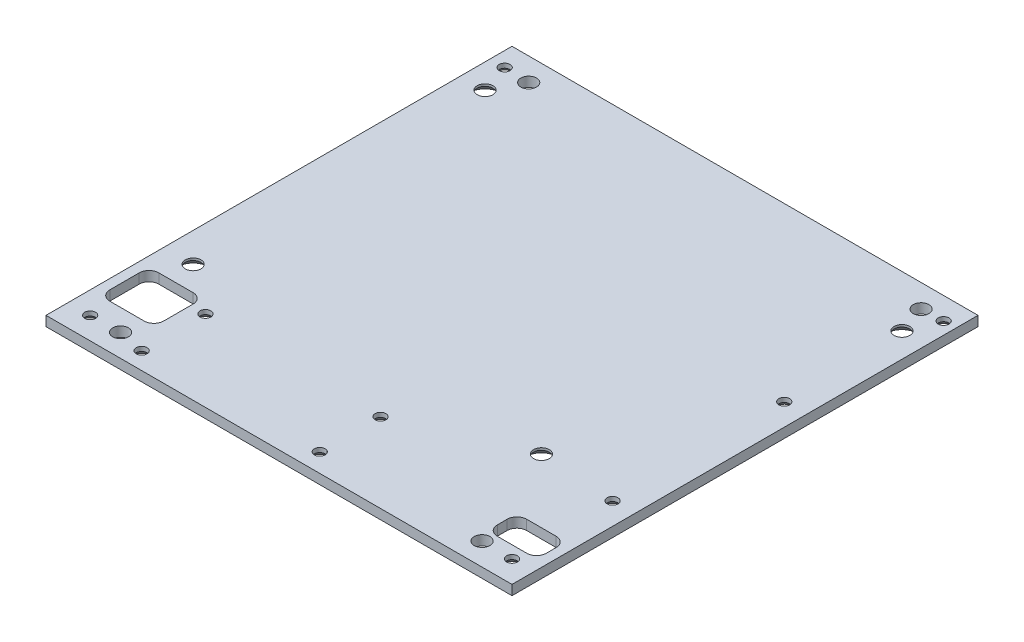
ISO-10303-21;
HEADER;
FILE_DESCRIPTION(('STEP AP214'),'2;1');
FILE_NAME('part.step','',(''),(''),'','','');
FILE_SCHEMA(('AUTOMOTIVE_DESIGN { 1 0 10303 214 1 1 1 1 }'));
ENDSEC;
DATA;
#1=APPLICATION_CONTEXT('core data for automotive mechanical design processes');
#2=APPLICATION_PROTOCOL_DEFINITION('international standard','automotive_design',2000,#1);
#3=PRODUCT_CONTEXT('',#1,'mechanical');
#4=PRODUCT('Part','Part','',(#3));
#5=PRODUCT_RELATED_PRODUCT_CATEGORY('part','',(#4));
#6=PRODUCT_DEFINITION_FORMATION('','',#4);
#7=PRODUCT_DEFINITION_CONTEXT('part definition',#1,'design');
#8=PRODUCT_DEFINITION('design','',#6,#7);
#9=PRODUCT_DEFINITION_SHAPE('','',#8);
#10=(LENGTH_UNIT() NAMED_UNIT(*) SI_UNIT(.MILLI.,.METRE.));
#11=(NAMED_UNIT(*) PLANE_ANGLE_UNIT() SI_UNIT($,.RADIAN.));
#12=(NAMED_UNIT(*) SI_UNIT($,.STERADIAN.) SOLID_ANGLE_UNIT());
#13=UNCERTAINTY_MEASURE_WITH_UNIT(LENGTH_MEASURE(1.E-05),#10,'distance_accuracy_value','');
#14=(GEOMETRIC_REPRESENTATION_CONTEXT(3) GLOBAL_UNCERTAINTY_ASSIGNED_CONTEXT((#13)) GLOBAL_UNIT_ASSIGNED_CONTEXT((#10,
#11,#12)) REPRESENTATION_CONTEXT('',''));
#15=CARTESIAN_POINT('',(0.,0.,0.));
#16=DIRECTION('',(0.,0.,1.));
#17=DIRECTION('',(1.,0.,0.));
#18=AXIS2_PLACEMENT_3D('',#15,#16,#17);
#19=CARTESIAN_POINT('',(-47.5,2.,-47.5));
#20=DIRECTION('',(1.,0.,0.));
#21=DIRECTION('',(0.,0.,-1.));
#22=AXIS2_PLACEMENT_3D('',#19,#20,#21);
#23=PLANE('',#22);
#24=DIRECTION('',(0.,0.,1.));
#25=VECTOR('',#24,1.);
#26=CARTESIAN_POINT('',(-47.5,0.,-47.5));
#27=LINE('',#26,#25);
#28=CARTESIAN_POINT('',(-47.5,0.,-47.5));
#29=VERTEX_POINT('',#28);
#30=CARTESIAN_POINT('',(-47.5,0.,47.5));
#31=VERTEX_POINT('',#30);
#32=EDGE_CURVE('E411',#29,#31,#27,.T.);
#33=ORIENTED_EDGE('',*,*,#32,.T.);
#34=DIRECTION('',(0.,-1.,0.));
#35=VECTOR('',#34,1.);
#36=CARTESIAN_POINT('',(-47.5,2.,47.5));
#37=LINE('',#36,#35);
#38=CARTESIAN_POINT('',(-47.5,2.,47.5));
#39=VERTEX_POINT('',#38);
#40=EDGE_CURVE('E438',#39,#31,#37,.T.);
#41=ORIENTED_EDGE('',*,*,#40,.F.);
#42=DIRECTION('',(0.,0.,1.));
#43=VECTOR('',#42,1.);
#44=CARTESIAN_POINT('',(-47.5,2.,-47.5));
#45=LINE('',#44,#43);
#46=CARTESIAN_POINT('',(-47.5,2.,-47.5));
#47=VERTEX_POINT('',#46);
#48=EDGE_CURVE('E412',#47,#39,#45,.T.);
#49=ORIENTED_EDGE('',*,*,#48,.F.);
#50=DIRECTION('',(0.,-1.,0.));
#51=VECTOR('',#50,1.);
#52=CARTESIAN_POINT('',(-47.5,2.,-47.5));
#53=LINE('',#52,#51);
#54=EDGE_CURVE('E422',#47,#29,#53,.T.);
#55=ORIENTED_EDGE('',*,*,#54,.T.);
#56=EDGE_LOOP('',(#33,#41,#49,#55));
#57=FACE_BOUND('',#56,.T.);
#58=ADVANCED_FACE('F33',(#57),#23,.F.);
#59=CARTESIAN_POINT('',(47.5,2.,47.5));
#60=DIRECTION('',(0.,0.,-1.));
#61=DIRECTION('',(-1.,0.,0.));
#62=AXIS2_PLACEMENT_3D('',#59,#60,#61);
#63=PLANE('',#62);
#64=DIRECTION('',(1.,0.,0.));
#65=VECTOR('',#64,1.);
#66=CARTESIAN_POINT('',(47.5,0.,47.5));
#67=LINE('',#66,#65);
#68=CARTESIAN_POINT('',(47.5,0.,47.5));
#69=VERTEX_POINT('',#68);
#70=EDGE_CURVE('E425',#31,#69,#67,.T.);
#71=ORIENTED_EDGE('',*,*,#70,.T.);
#72=DIRECTION('',(0.,-1.,0.));
#73=VECTOR('',#72,1.);
#74=CARTESIAN_POINT('',(47.5,2.,47.5));
#75=LINE('',#74,#73);
#76=CARTESIAN_POINT('',(47.5,2.,47.5));
#77=VERTEX_POINT('',#76);
#78=EDGE_CURVE('E435',#77,#69,#75,.T.);
#79=ORIENTED_EDGE('',*,*,#78,.F.);
#80=DIRECTION('',(1.,0.,0.));
#81=VECTOR('',#80,1.);
#82=CARTESIAN_POINT('',(47.5,2.,47.5));
#83=LINE('',#82,#81);
#84=EDGE_CURVE('E415',#39,#77,#83,.T.);
#85=ORIENTED_EDGE('',*,*,#84,.F.);
#86=ORIENTED_EDGE('',*,*,#40,.T.);
#87=EDGE_LOOP('',(#71,#79,#85,#86));
#88=FACE_BOUND('',#87,.T.);
#89=ADVANCED_FACE('F505',(#88),#63,.F.);
#90=CARTESIAN_POINT('',(47.5,2.,-47.5));
#91=DIRECTION('',(-1.,0.,0.));
#92=DIRECTION('',(0.,0.,1.));
#93=AXIS2_PLACEMENT_3D('',#90,#91,#92);
#94=PLANE('',#93);
#95=DIRECTION('',(0.,0.,-1.));
#96=VECTOR('',#95,1.);
#97=CARTESIAN_POINT('',(47.5,0.,-47.5));
#98=LINE('',#97,#96);
#99=CARTESIAN_POINT('',(47.5,0.,-47.5));
#100=VERTEX_POINT('',#99);
#101=EDGE_CURVE('E427',#69,#100,#98,.T.);
#102=ORIENTED_EDGE('',*,*,#101,.T.);
#103=DIRECTION('',(0.,-1.,0.));
#104=VECTOR('',#103,1.);
#105=CARTESIAN_POINT('',(47.5,2.,-47.5));
#106=LINE('',#105,#104);
#107=CARTESIAN_POINT('',(47.5,2.,-47.5));
#108=VERTEX_POINT('',#107);
#109=EDGE_CURVE('E432',#108,#100,#106,.T.);
#110=ORIENTED_EDGE('',*,*,#109,.F.);
#111=DIRECTION('',(0.,0.,-1.));
#112=VECTOR('',#111,1.);
#113=CARTESIAN_POINT('',(47.5,2.,-47.5));
#114=LINE('',#113,#112);
#115=EDGE_CURVE('E418',#77,#108,#114,.T.);
#116=ORIENTED_EDGE('',*,*,#115,.F.);
#117=ORIENTED_EDGE('',*,*,#78,.T.);
#118=EDGE_LOOP('',(#102,#110,#116,#117));
#119=FACE_BOUND('',#118,.T.);
#120=ADVANCED_FACE('F510',(#119),#94,.F.);
#121=CARTESIAN_POINT('',(47.5,2.,-47.5));
#122=DIRECTION('',(0.,0.,1.));
#123=DIRECTION('',(1.,0.,0.));
#124=AXIS2_PLACEMENT_3D('',#121,#122,#123);
#125=PLANE('',#124);
#126=DIRECTION('',(-1.,0.,0.));
#127=VECTOR('',#126,1.);
#128=CARTESIAN_POINT('',(47.5,0.,-47.5));
#129=LINE('',#128,#127);
#130=EDGE_CURVE('E416',#100,#29,#129,.T.);
#131=ORIENTED_EDGE('',*,*,#130,.T.);
#132=ORIENTED_EDGE('',*,*,#54,.F.);
#133=DIRECTION('',(-1.,0.,0.));
#134=VECTOR('',#133,1.);
#135=CARTESIAN_POINT('',(47.5,2.,-47.5));
#136=LINE('',#135,#134);
#137=EDGE_CURVE('E420',#108,#47,#136,.T.);
#138=ORIENTED_EDGE('',*,*,#137,.F.);
#139=ORIENTED_EDGE('',*,*,#109,.T.);
#140=EDGE_LOOP('',(#131,#132,#138,#139));
#141=FACE_BOUND('',#140,.T.);
#142=ADVANCED_FACE('F525',(#141),#125,.F.);
#143=CARTESIAN_POINT('',(0.,2.,0.));
#144=DIRECTION('',(0.,-1.,0.));
#145=DIRECTION('',(0.,0.,-1.));
#146=AXIS2_PLACEMENT_3D('',#143,#144,#145);
#147=PLANE('',#146);
#148=CARTESIAN_POINT('',(43.,2.,22.5));
#149=DIRECTION('',(0.,-1.,0.));
#150=DIRECTION('',(0.,0.,-1.));
#151=AXIS2_PLACEMENT_3D('',#148,#149,#150);
#152=CIRCLE('',#151,1.1);
#153=CARTESIAN_POINT('',(43.,2.,21.4));
#154=VERTEX_POINT('',#153);
#155=EDGE_CURVE('E820',#154,#154,#152,.T.);
#156=ORIENTED_EDGE('',*,*,#155,.T.);
#157=EDGE_LOOP('',(#156));
#158=FACE_BOUND('',#157,.T.);
#159=CARTESIAN_POINT('',(43.,2.,-12.5));
#160=DIRECTION('',(0.,-1.,0.));
#161=DIRECTION('',(0.,0.,-1.));
#162=AXIS2_PLACEMENT_3D('',#159,#160,#161);
#163=CIRCLE('',#162,1.1);
#164=CARTESIAN_POINT('',(43.,2.,-13.6));
#165=VERTEX_POINT('',#164);
#166=EDGE_CURVE('E193',#165,#165,#163,.T.);
#167=ORIENTED_EDGE('',*,*,#166,.T.);
#168=EDGE_LOOP('',(#167));
#169=FACE_BOUND('',#168,.T.);
#170=DIRECTION('',(0.,0.,-1.));
#171=VECTOR('',#170,1.);
#172=CARTESIAN_POINT('',(-45.5,2.,36.5));
#173=LINE('',#172,#171);
#174=CARTESIAN_POINT('',(-45.5,2.,36.5));
#175=VERTEX_POINT('',#174);
#176=CARTESIAN_POINT('',(-45.5,2.,30.5));
#177=VERTEX_POINT('',#176);
#178=EDGE_CURVE('E176',#175,#177,#173,.T.);
#179=ORIENTED_EDGE('',*,*,#178,.T.);
#180=CARTESIAN_POINT('',(-43.5,2.,30.5));
#181=DIRECTION('',(0.,-1.,0.));
#182=DIRECTION('',(0.,0.,-1.));
#183=AXIS2_PLACEMENT_3D('',#180,#181,#182);
#184=CIRCLE('',#183,2.);
#185=CARTESIAN_POINT('',(-43.5,2.,28.5));
#186=VERTEX_POINT('',#185);
#187=EDGE_CURVE('E170',#177,#186,#184,.T.);
#188=ORIENTED_EDGE('',*,*,#187,.T.);
#189=DIRECTION('',(1.,0.,0.));
#190=VECTOR('',#189,1.);
#191=CARTESIAN_POINT('',(-43.5,2.,28.5));
#192=LINE('',#191,#190);
#193=CARTESIAN_POINT('',(-36.5,2.,28.5));
#194=VERTEX_POINT('',#193);
#195=EDGE_CURVE('E179',#186,#194,#192,.T.);
#196=ORIENTED_EDGE('',*,*,#195,.T.);
#197=CARTESIAN_POINT('',(-36.5,2.,30.5));
#198=DIRECTION('',(0.,-1.,0.));
#199=DIRECTION('',(0.,0.,-1.));
#200=AXIS2_PLACEMENT_3D('',#197,#198,#199);
#201=CIRCLE('',#200,2.);
#202=CARTESIAN_POINT('',(-34.5,2.,30.5));
#203=VERTEX_POINT('',#202);
#204=EDGE_CURVE('E47',#194,#203,#201,.T.);
#205=ORIENTED_EDGE('',*,*,#204,.T.);
#206=DIRECTION('',(0.,0.,1.));
#207=VECTOR('',#206,1.);
#208=CARTESIAN_POINT('',(-34.5,2.,36.5));
#209=LINE('',#208,#207);
#210=CARTESIAN_POINT('',(-34.5,2.,36.5));
#211=VERTEX_POINT('',#210);
#212=EDGE_CURVE('E197',#203,#211,#209,.T.);
#213=ORIENTED_EDGE('',*,*,#212,.T.);
#214=CARTESIAN_POINT('',(-36.5,2.,36.5));
#215=DIRECTION('',(0.,-1.,0.));
#216=DIRECTION('',(0.,0.,1.));
#217=AXIS2_PLACEMENT_3D('',#214,#215,#216);
#218=CIRCLE('',#217,2.);
#219=CARTESIAN_POINT('',(-36.5,2.,38.5));
#220=VERTEX_POINT('',#219);
#221=EDGE_CURVE('E200',#211,#220,#218,.T.);
#222=ORIENTED_EDGE('',*,*,#221,.T.);
#223=DIRECTION('',(-1.,0.,0.));
#224=VECTOR('',#223,1.);
#225=CARTESIAN_POINT('',(-43.5,2.,38.5));
#226=LINE('',#225,#224);
#227=CARTESIAN_POINT('',(-43.5,2.,38.5));
#228=VERTEX_POINT('',#227);
#229=EDGE_CURVE('E203',#220,#228,#226,.T.);
#230=ORIENTED_EDGE('',*,*,#229,.T.);
#231=CARTESIAN_POINT('',(-43.5,2.,36.5));
#232=DIRECTION('',(0.,-1.,0.));
#233=DIRECTION('',(0.,0.,-1.));
#234=AXIS2_PLACEMENT_3D('',#231,#232,#233);
#235=CIRCLE('',#234,2.);
#236=EDGE_CURVE('E206',#228,#175,#235,.T.);
#237=ORIENTED_EDGE('',*,*,#236,.T.);
#238=EDGE_LOOP('',(#179,#188,#196,#205,#213,#222,#230,#237));
#239=FACE_BOUND('',#238,.T.);
#240=DIRECTION('',(0.,0.,-1.));
#241=VECTOR('',#240,1.);
#242=CARTESIAN_POINT('',(45.5,2.,36.5));
#243=LINE('',#242,#241);
#244=CARTESIAN_POINT('',(45.5,2.,38.5));
#245=VERTEX_POINT('',#244);
#246=CARTESIAN_POINT('',(45.5,2.,36.5));
#247=VERTEX_POINT('',#246);
#248=EDGE_CURVE('E241',#245,#247,#243,.T.);
#249=ORIENTED_EDGE('',*,*,#248,.F.);
#250=CARTESIAN_POINT('',(43.5,2.,38.5));
#251=DIRECTION('',(0.,1.,0.));
#252=DIRECTION('',(0.,0.,1.));
#253=AXIS2_PLACEMENT_3D('',#250,#251,#252);
#254=CIRCLE('',#253,2.);
#255=CARTESIAN_POINT('',(43.5,2.,40.5));
#256=VERTEX_POINT('',#255);
#257=EDGE_CURVE('E228',#256,#245,#254,.T.);
#258=ORIENTED_EDGE('',*,*,#257,.F.);
#259=DIRECTION('',(1.,0.,0.));
#260=VECTOR('',#259,1.);
#261=CARTESIAN_POINT('',(37.5,2.,40.5));
#262=LINE('',#261,#260);
#263=CARTESIAN_POINT('',(37.5,2.,40.5));
#264=VERTEX_POINT('',#263);
#265=EDGE_CURVE('E259',#264,#256,#262,.T.);
#266=ORIENTED_EDGE('',*,*,#265,.F.);
#267=CARTESIAN_POINT('',(37.5,2.,38.5));
#268=DIRECTION('',(0.,1.,0.));
#269=DIRECTION('',(0.,0.,1.));
#270=AXIS2_PLACEMENT_3D('',#267,#268,#269);
#271=CIRCLE('',#270,2.);
#272=CARTESIAN_POINT('',(35.5,2.,38.5));
#273=VERTEX_POINT('',#272);
#274=EDGE_CURVE('E256',#273,#264,#271,.T.);
#275=ORIENTED_EDGE('',*,*,#274,.F.);
#276=DIRECTION('',(0.,0.,1.));
#277=VECTOR('',#276,1.);
#278=CARTESIAN_POINT('',(35.5,2.,36.5));
#279=LINE('',#278,#277);
#280=CARTESIAN_POINT('',(35.5,2.,36.5));
#281=VERTEX_POINT('',#280);
#282=EDGE_CURVE('E253',#281,#273,#279,.T.);
#283=ORIENTED_EDGE('',*,*,#282,.F.);
#284=CARTESIAN_POINT('',(37.5,2.,36.5));
#285=DIRECTION('',(0.,1.,0.));
#286=DIRECTION('',(0.,0.,1.));
#287=AXIS2_PLACEMENT_3D('',#284,#285,#286);
#288=CIRCLE('',#287,2.);
#289=CARTESIAN_POINT('',(37.5,2.,34.5));
#290=VERTEX_POINT('',#289);
#291=EDGE_CURVE('E250',#290,#281,#288,.T.);
#292=ORIENTED_EDGE('',*,*,#291,.F.);
#293=DIRECTION('',(-1.,0.,0.));
#294=VECTOR('',#293,1.);
#295=CARTESIAN_POINT('',(37.5,2.,34.5));
#296=LINE('',#295,#294);
#297=CARTESIAN_POINT('',(43.5,2.,34.5));
#298=VERTEX_POINT('',#297);
#299=EDGE_CURVE('E247',#298,#290,#296,.T.);
#300=ORIENTED_EDGE('',*,*,#299,.F.);
#301=CARTESIAN_POINT('',(43.5,2.,36.5));
#302=DIRECTION('',(0.,1.,0.));
#303=DIRECTION('',(0.,0.,-1.));
#304=AXIS2_PLACEMENT_3D('',#301,#302,#303);
#305=CIRCLE('',#304,2.);
#306=EDGE_CURVE('E244',#247,#298,#305,.T.);
#307=ORIENTED_EDGE('',*,*,#306,.F.);
#308=EDGE_LOOP('',(#249,#258,#266,#275,#283,#292,#300,#307));
#309=FACE_BOUND('',#308,.T.);
#310=CARTESIAN_POINT('',(-43.,2.,43.));
#311=DIRECTION('',(0.,-1.,0.));
#312=DIRECTION('',(0.,0.,-1.));
#313=AXIS2_PLACEMENT_3D('',#310,#311,#312);
#314=CIRCLE('',#313,1.09999999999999);
#315=CARTESIAN_POINT('',(-43.,2.,41.9));
#316=VERTEX_POINT('',#315);
#317=EDGE_CURVE('E285',#316,#316,#314,.T.);
#318=ORIENTED_EDGE('',*,*,#317,.T.);
#319=EDGE_LOOP('',(#318));
#320=FACE_BOUND('',#319,.T.);
#321=CARTESIAN_POINT('',(43.,2.,43.));
#322=DIRECTION('',(0.,-1.,0.));
#323=DIRECTION('',(0.,0.,-1.));
#324=AXIS2_PLACEMENT_3D('',#321,#322,#323);
#325=CIRCLE('',#324,1.09999999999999);
#326=CARTESIAN_POINT('',(43.,2.,41.9));
#327=VERTEX_POINT('',#326);
#328=EDGE_CURVE('E294',#327,#327,#325,.T.);
#329=ORIENTED_EDGE('',*,*,#328,.T.);
#330=EDGE_LOOP('',(#329));
#331=FACE_BOUND('',#330,.T.);
#332=CARTESIAN_POINT('',(-44.5,2.,-43.));
#333=DIRECTION('',(0.,-1.,0.));
#334=DIRECTION('',(0.,0.,-1.));
#335=AXIS2_PLACEMENT_3D('',#332,#333,#334);
#336=CIRCLE('',#335,1.09999999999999);
#337=CARTESIAN_POINT('',(-44.5,2.,-44.1));
#338=VERTEX_POINT('',#337);
#339=EDGE_CURVE('E303',#338,#338,#336,.T.);
#340=ORIENTED_EDGE('',*,*,#339,.T.);
#341=EDGE_LOOP('',(#340));
#342=FACE_BOUND('',#341,.T.);
#343=CARTESIAN_POINT('',(45.,2.,-43.));
#344=DIRECTION('',(0.,-1.,0.));
#345=DIRECTION('',(0.,0.,-1.));
#346=AXIS2_PLACEMENT_3D('',#343,#344,#345);
#347=CIRCLE('',#346,1.09999999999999);
#348=CARTESIAN_POINT('',(45.,2.,-44.1));
#349=VERTEX_POINT('',#348);
#350=EDGE_CURVE('E312',#349,#349,#347,.T.);
#351=ORIENTED_EDGE('',*,*,#350,.T.);
#352=EDGE_LOOP('',(#351));
#353=FACE_BOUND('',#352,.T.);
#354=CARTESIAN_POINT('',(-36.9,2.,42.9));
#355=DIRECTION('',(0.,-1.,0.));
#356=DIRECTION('',(0.,0.,-1.));
#357=AXIS2_PLACEMENT_3D('',#354,#355,#356);
#358=CIRCLE('',#357,1.6);
#359=CARTESIAN_POINT('',(-36.9,2.,41.3));
#360=VERTEX_POINT('',#359);
#361=EDGE_CURVE('E318',#360,#360,#358,.T.);
#362=ORIENTED_EDGE('',*,*,#361,.T.);
#363=EDGE_LOOP('',(#362));
#364=FACE_BOUND('',#363,.T.);
#365=CARTESIAN_POINT('',(36.8,2.,42.9));
#366=DIRECTION('',(0.,-1.,0.));
#367=DIRECTION('',(0.,0.,-1.));
#368=AXIS2_PLACEMENT_3D('',#365,#366,#367);
#369=CIRCLE('',#368,1.6);
#370=CARTESIAN_POINT('',(36.8,2.,41.3));
#371=VERTEX_POINT('',#370);
#372=EDGE_CURVE('E324',#371,#371,#369,.T.);
#373=ORIENTED_EDGE('',*,*,#372,.T.);
#374=EDGE_LOOP('',(#373));
#375=FACE_BOUND('',#374,.T.);
#376=CARTESIAN_POINT('',(40.6,2.,-42.8));
#377=DIRECTION('',(0.,-1.,0.));
#378=DIRECTION('',(0.,0.,-1.));
#379=AXIS2_PLACEMENT_3D('',#376,#377,#378);
#380=CIRCLE('',#379,1.6);
#381=CARTESIAN_POINT('',(40.6,2.,-44.4));
#382=VERTEX_POINT('',#381);
#383=EDGE_CURVE('E330',#382,#382,#380,.T.);
#384=ORIENTED_EDGE('',*,*,#383,.T.);
#385=EDGE_LOOP('',(#384));
#386=FACE_BOUND('',#385,.T.);
#387=CARTESIAN_POINT('',(-39.4,2.,-42.8));
#388=DIRECTION('',(0.,-1.,0.));
#389=DIRECTION('',(0.,0.,-1.));
#390=AXIS2_PLACEMENT_3D('',#387,#388,#389);
#391=CIRCLE('',#390,1.6);
#392=CARTESIAN_POINT('',(-39.4,2.,-44.4));
#393=VERTEX_POINT('',#392);
#394=EDGE_CURVE('E336',#393,#393,#391,.T.);
#395=ORIENTED_EDGE('',*,*,#394,.T.);
#396=EDGE_LOOP('',(#395));
#397=FACE_BOUND('',#396,.T.);
#398=CARTESIAN_POINT('',(-31.5,2.,44.));
#399=DIRECTION('',(0.,-1.,0.));
#400=DIRECTION('',(0.,0.,-1.));
#401=AXIS2_PLACEMENT_3D('',#398,#399,#400);
#402=CIRCLE('',#401,1.09999999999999);
#403=CARTESIAN_POINT('',(-31.5,2.,42.9));
#404=VERTEX_POINT('',#403);
#405=EDGE_CURVE('E345',#404,#404,#402,.T.);
#406=ORIENTED_EDGE('',*,*,#405,.T.);
#407=EDGE_LOOP('',(#406));
#408=FACE_BOUND('',#407,.T.);
#409=CARTESIAN_POINT('',(-31.5,2.,31.));
#410=DIRECTION('',(0.,-1.,0.));
#411=DIRECTION('',(0.,0.,-1.));
#412=AXIS2_PLACEMENT_3D('',#409,#410,#411);
#413=CIRCLE('',#412,1.09999999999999);
#414=CARTESIAN_POINT('',(-31.5,2.,29.9));
#415=VERTEX_POINT('',#414);
#416=EDGE_CURVE('E354',#415,#415,#413,.T.);
#417=ORIENTED_EDGE('',*,*,#416,.T.);
#418=EDGE_LOOP('',(#417));
#419=FACE_BOUND('',#418,.T.);
#420=CARTESIAN_POINT('',(4.5,2.,31.3000000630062));
#421=DIRECTION('',(0.,-1.,0.));
#422=DIRECTION('',(0.,0.,-1.));
#423=AXIS2_PLACEMENT_3D('',#420,#421,#422);
#424=CIRCLE('',#423,1.09999999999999);
#425=CARTESIAN_POINT('',(4.5,2.,30.2000000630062));
#426=VERTEX_POINT('',#425);
#427=EDGE_CURVE('E363',#426,#426,#424,.T.);
#428=ORIENTED_EDGE('',*,*,#427,.T.);
#429=EDGE_LOOP('',(#428));
#430=FACE_BOUND('',#429,.T.);
#431=CARTESIAN_POINT('',(4.49874997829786,2.,43.7));
#432=DIRECTION('',(0.,-1.,0.));
#433=DIRECTION('',(0.,0.,-1.));
#434=AXIS2_PLACEMENT_3D('',#431,#432,#433);
#435=CIRCLE('',#434,1.09999999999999);
#436=CARTESIAN_POINT('',(4.49874997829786,2.,42.6));
#437=VERTEX_POINT('',#436);
#438=EDGE_CURVE('E372',#437,#437,#435,.T.);
#439=ORIENTED_EDGE('',*,*,#438,.T.);
#440=EDGE_LOOP('',(#439));
#441=FACE_BOUND('',#440,.T.);
#442=CARTESIAN_POINT('',(-41.5,2.,23.5));
#443=DIRECTION('',(0.,-1.,0.));
#444=DIRECTION('',(0.,0.,-1.));
#445=AXIS2_PLACEMENT_3D('',#442,#443,#444);
#446=CIRCLE('',#445,1.59999999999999);
#447=CARTESIAN_POINT('',(-41.5,2.,21.9));
#448=VERTEX_POINT('',#447);
#449=EDGE_CURVE('E381',#448,#448,#446,.T.);
#450=ORIENTED_EDGE('',*,*,#449,.T.);
#451=EDGE_LOOP('',(#450));
#452=FACE_BOUND('',#451,.T.);
#453=CARTESIAN_POINT('',(-42.5,2.,-37.));
#454=DIRECTION('',(0.,-1.,0.));
#455=DIRECTION('',(0.,0.,-1.));
#456=AXIS2_PLACEMENT_3D('',#453,#454,#455);
#457=CIRCLE('',#456,1.59999999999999);
#458=CARTESIAN_POINT('',(-42.5,2.,-38.6));
#459=VERTEX_POINT('',#458);
#460=EDGE_CURVE('E390',#459,#459,#457,.T.);
#461=ORIENTED_EDGE('',*,*,#460,.T.);
#462=EDGE_LOOP('',(#461));
#463=FACE_BOUND('',#462,.T.);
#464=CARTESIAN_POINT('',(42.5,2.,-37.));
#465=DIRECTION('',(0.,-1.,0.));
#466=DIRECTION('',(0.,0.,-1.));
#467=AXIS2_PLACEMENT_3D('',#464,#465,#466);
#468=CIRCLE('',#467,1.59999999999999);
#469=CARTESIAN_POINT('',(42.5,2.,-38.6));
#470=VERTEX_POINT('',#469);
#471=EDGE_CURVE('E399',#470,#470,#468,.T.);
#472=ORIENTED_EDGE('',*,*,#471,.T.);
#473=EDGE_LOOP('',(#472));
#474=FACE_BOUND('',#473,.T.);
#475=CARTESIAN_POINT('',(27.5,2.,21.5));
#476=DIRECTION('',(0.,-1.,0.));
#477=DIRECTION('',(0.,0.,-1.));
#478=AXIS2_PLACEMENT_3D('',#475,#476,#477);
#479=CIRCLE('',#478,1.59999999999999);
#480=CARTESIAN_POINT('',(27.5,2.,19.9));
#481=VERTEX_POINT('',#480);
#482=EDGE_CURVE('E408',#481,#481,#479,.T.);
#483=ORIENTED_EDGE('',*,*,#482,.T.);
#484=EDGE_LOOP('',(#483));
#485=FACE_BOUND('',#484,.T.);
#486=ORIENTED_EDGE('',*,*,#48,.T.);
#487=ORIENTED_EDGE('',*,*,#84,.T.);
#488=ORIENTED_EDGE('',*,*,#115,.T.);
#489=ORIENTED_EDGE('',*,*,#137,.T.);
#490=EDGE_LOOP('',(#486,#487,#488,#489));
#491=FACE_BOUND('',#490,.T.);
#492=ADVANCED_FACE('F183',(#158,#169,#239,#309,#320,#331,#342,#353,#364,#375,#386,#397,#408,
#419,#430,#441,#452,#463,#474,#485,#491),#147,.F.);
#493=CARTESIAN_POINT('',(0.,0.,0.));
#494=DIRECTION('',(0.,-1.,0.));
#495=DIRECTION('',(0.,0.,-1.));
#496=AXIS2_PLACEMENT_3D('',#493,#494,#495);
#497=PLANE('',#496);
#498=CARTESIAN_POINT('',(43.,0.,22.5));
#499=DIRECTION('',(0.,-1.,0.));
#500=DIRECTION('',(0.,0.,-1.));
#501=AXIS2_PLACEMENT_3D('',#498,#499,#500);
#502=CIRCLE('',#501,2.2);
#503=CARTESIAN_POINT('',(43.,0.,20.3));
#504=VERTEX_POINT('',#503);
#505=EDGE_CURVE('E818',#504,#504,#502,.T.);
#506=ORIENTED_EDGE('',*,*,#505,.F.);
#507=EDGE_LOOP('',(#506));
#508=FACE_BOUND('',#507,.T.);
#509=CARTESIAN_POINT('',(43.,0.,-12.5));
#510=DIRECTION('',(0.,-1.,0.));
#511=DIRECTION('',(0.,0.,-1.));
#512=AXIS2_PLACEMENT_3D('',#509,#510,#511);
#513=CIRCLE('',#512,2.2);
#514=CARTESIAN_POINT('',(43.,0.,-14.7));
#515=VERTEX_POINT('',#514);
#516=EDGE_CURVE('E825',#515,#515,#513,.T.);
#517=ORIENTED_EDGE('',*,*,#516,.F.);
#518=EDGE_LOOP('',(#517));
#519=FACE_BOUND('',#518,.T.);
#520=CARTESIAN_POINT('',(-43.5,0.,30.5));
#521=DIRECTION('',(0.,-1.,0.));
#522=DIRECTION('',(0.,0.,-1.));
#523=AXIS2_PLACEMENT_3D('',#520,#521,#522);
#524=CIRCLE('',#523,2.);
#525=CARTESIAN_POINT('',(-45.5,0.,30.5));
#526=VERTEX_POINT('',#525);
#527=CARTESIAN_POINT('',(-43.5,0.,28.5));
#528=VERTEX_POINT('',#527);
#529=EDGE_CURVE('E55',#526,#528,#524,.T.);
#530=ORIENTED_EDGE('',*,*,#529,.F.);
#531=DIRECTION('',(0.,0.,-1.));
#532=VECTOR('',#531,1.);
#533=CARTESIAN_POINT('',(-45.5,0.,36.5));
#534=LINE('',#533,#532);
#535=CARTESIAN_POINT('',(-45.5,0.,36.5));
#536=VERTEX_POINT('',#535);
#537=EDGE_CURVE('E187',#536,#526,#534,.T.);
#538=ORIENTED_EDGE('',*,*,#537,.F.);
#539=CARTESIAN_POINT('',(-43.5,0.,36.5));
#540=DIRECTION('',(0.,-1.,0.));
#541=DIRECTION('',(0.,0.,-1.));
#542=AXIS2_PLACEMENT_3D('',#539,#540,#541);
#543=CIRCLE('',#542,2.);
#544=CARTESIAN_POINT('',(-43.5,0.,38.5));
#545=VERTEX_POINT('',#544);
#546=EDGE_CURVE('E190',#545,#536,#543,.T.);
#547=ORIENTED_EDGE('',*,*,#546,.F.);
#548=DIRECTION('',(-1.,0.,0.));
#549=VECTOR('',#548,1.);
#550=CARTESIAN_POINT('',(-43.5,0.,38.5));
#551=LINE('',#550,#549);
#552=CARTESIAN_POINT('',(-36.5,0.,38.5));
#553=VERTEX_POINT('',#552);
#554=EDGE_CURVE('E221',#553,#545,#551,.T.);
#555=ORIENTED_EDGE('',*,*,#554,.F.);
#556=CARTESIAN_POINT('',(-36.5,0.,36.5));
#557=DIRECTION('',(0.,-1.,0.));
#558=DIRECTION('',(0.,0.,1.));
#559=AXIS2_PLACEMENT_3D('',#556,#557,#558);
#560=CIRCLE('',#559,2.);
#561=CARTESIAN_POINT('',(-34.5,0.,36.5));
#562=VERTEX_POINT('',#561);
#563=EDGE_CURVE('E218',#562,#553,#560,.T.);
#564=ORIENTED_EDGE('',*,*,#563,.F.);
#565=DIRECTION('',(0.,0.,1.));
#566=VECTOR('',#565,1.);
#567=CARTESIAN_POINT('',(-34.5,0.,36.5));
#568=LINE('',#567,#566);
#569=CARTESIAN_POINT('',(-34.5,0.,30.5));
#570=VERTEX_POINT('',#569);
#571=EDGE_CURVE('E215',#570,#562,#568,.T.);
#572=ORIENTED_EDGE('',*,*,#571,.F.);
#573=CARTESIAN_POINT('',(-36.5,0.,30.5));
#574=DIRECTION('',(0.,-1.,0.));
#575=DIRECTION('',(0.,0.,-1.));
#576=AXIS2_PLACEMENT_3D('',#573,#574,#575);
#577=CIRCLE('',#576,2.);
#578=CARTESIAN_POINT('',(-36.5,0.,28.5));
#579=VERTEX_POINT('',#578);
#580=EDGE_CURVE('E212',#579,#570,#577,.T.);
#581=ORIENTED_EDGE('',*,*,#580,.F.);
#582=DIRECTION('',(1.,0.,0.));
#583=VECTOR('',#582,1.);
#584=CARTESIAN_POINT('',(-43.5,0.,28.5));
#585=LINE('',#584,#583);
#586=EDGE_CURVE('E210',#528,#579,#585,.T.);
#587=ORIENTED_EDGE('',*,*,#586,.F.);
#588=EDGE_LOOP('',(#530,#538,#547,#555,#564,#572,#581,#587));
#589=FACE_BOUND('',#588,.T.);
#590=CARTESIAN_POINT('',(43.5,0.,38.5));
#591=DIRECTION('',(0.,-1.,0.));
#592=DIRECTION('',(0.,0.,-1.));
#593=AXIS2_PLACEMENT_3D('',#590,#591,#592);
#594=CIRCLE('',#593,2.);
#595=CARTESIAN_POINT('',(45.5,0.,38.5));
#596=VERTEX_POINT('',#595);
#597=CARTESIAN_POINT('',(43.5,0.,40.5));
#598=VERTEX_POINT('',#597);
#599=EDGE_CURVE('E11',#596,#598,#594,.T.);
#600=ORIENTED_EDGE('',*,*,#599,.F.);
#601=DIRECTION('',(0.,0.,1.));
#602=VECTOR('',#601,1.);
#603=CARTESIAN_POINT('',(45.5,0.,0.));
#604=LINE('',#603,#602);
#605=CARTESIAN_POINT('',(45.5,0.,36.5));
#606=VERTEX_POINT('',#605);
#607=EDGE_CURVE('E441',#606,#596,#604,.T.);
#608=ORIENTED_EDGE('',*,*,#607,.F.);
#609=CARTESIAN_POINT('',(43.5,0.,36.5));
#610=DIRECTION('',(0.,-1.,0.));
#611=DIRECTION('',(0.,0.,-1.));
#612=AXIS2_PLACEMENT_3D('',#609,#610,#611);
#613=CIRCLE('',#612,2.);
#614=CARTESIAN_POINT('',(43.5,0.,34.5));
#615=VERTEX_POINT('',#614);
#616=EDGE_CURVE('E443',#615,#606,#613,.T.);
#617=ORIENTED_EDGE('',*,*,#616,.F.);
#618=DIRECTION('',(1.,0.,0.));
#619=VECTOR('',#618,1.);
#620=CARTESIAN_POINT('',(0.,0.,34.5));
#621=LINE('',#620,#619);
#622=CARTESIAN_POINT('',(37.5,0.,34.5));
#623=VERTEX_POINT('',#622);
#624=EDGE_CURVE('E446',#623,#615,#621,.T.);
#625=ORIENTED_EDGE('',*,*,#624,.F.);
#626=CARTESIAN_POINT('',(37.5,0.,36.5));
#627=DIRECTION('',(0.,-1.,0.));
#628=DIRECTION('',(0.,0.,-1.));
#629=AXIS2_PLACEMENT_3D('',#626,#627,#628);
#630=CIRCLE('',#629,2.);
#631=CARTESIAN_POINT('',(35.5,0.,36.5));
#632=VERTEX_POINT('',#631);
#633=EDGE_CURVE('E448',#632,#623,#630,.T.);
#634=ORIENTED_EDGE('',*,*,#633,.F.);
#635=DIRECTION('',(0.,0.,-1.));
#636=VECTOR('',#635,1.);
#637=CARTESIAN_POINT('',(35.5,0.,0.));
#638=LINE('',#637,#636);
#639=CARTESIAN_POINT('',(35.5,0.,38.5));
#640=VERTEX_POINT('',#639);
#641=EDGE_CURVE('E450',#640,#632,#638,.T.);
#642=ORIENTED_EDGE('',*,*,#641,.F.);
#643=CARTESIAN_POINT('',(37.5,0.,38.5));
#644=DIRECTION('',(0.,-1.,0.));
#645=DIRECTION('',(0.,0.,-1.));
#646=AXIS2_PLACEMENT_3D('',#643,#644,#645);
#647=CIRCLE('',#646,2.);
#648=CARTESIAN_POINT('',(37.5,0.,40.5));
#649=VERTEX_POINT('',#648);
#650=EDGE_CURVE('E452',#649,#640,#647,.T.);
#651=ORIENTED_EDGE('',*,*,#650,.F.);
#652=DIRECTION('',(-1.,0.,0.));
#653=VECTOR('',#652,1.);
#654=CARTESIAN_POINT('',(0.,0.,40.5));
#655=LINE('',#654,#653);
#656=EDGE_CURVE('E40',#598,#649,#655,.T.);
#657=ORIENTED_EDGE('',*,*,#656,.F.);
#658=EDGE_LOOP('',(#600,#608,#617,#625,#634,#642,#651,#657));
#659=FACE_BOUND('',#658,.T.);
#660=CARTESIAN_POINT('',(-43.,0.,43.));
#661=DIRECTION('',(0.,-1.,0.));
#662=DIRECTION('',(0.,0.,-1.));
#663=AXIS2_PLACEMENT_3D('',#660,#661,#662);
#664=CIRCLE('',#663,2.2);
#665=CARTESIAN_POINT('',(-43.,0.,40.8));
#666=VERTEX_POINT('',#665);
#667=EDGE_CURVE('E265',#666,#666,#664,.T.);
#668=ORIENTED_EDGE('',*,*,#667,.F.);
#669=EDGE_LOOP('',(#668));
#670=FACE_BOUND('',#669,.T.);
#671=CARTESIAN_POINT('',(43.,0.,43.));
#672=DIRECTION('',(0.,-1.,0.));
#673=DIRECTION('',(0.,0.,-1.));
#674=AXIS2_PLACEMENT_3D('',#671,#672,#673);
#675=CIRCLE('',#674,2.2);
#676=CARTESIAN_POINT('',(43.,0.,40.8));
#677=VERTEX_POINT('',#676);
#678=EDGE_CURVE('E288',#677,#677,#675,.T.);
#679=ORIENTED_EDGE('',*,*,#678,.F.);
#680=EDGE_LOOP('',(#679));
#681=FACE_BOUND('',#680,.T.);
#682=CARTESIAN_POINT('',(-44.5,0.,-43.));
#683=DIRECTION('',(0.,-1.,0.));
#684=DIRECTION('',(0.,0.,-1.));
#685=AXIS2_PLACEMENT_3D('',#682,#683,#684);
#686=CIRCLE('',#685,2.2);
#687=CARTESIAN_POINT('',(-44.5,0.,-45.2));
#688=VERTEX_POINT('',#687);
#689=EDGE_CURVE('E297',#688,#688,#686,.T.);
#690=ORIENTED_EDGE('',*,*,#689,.F.);
#691=EDGE_LOOP('',(#690));
#692=FACE_BOUND('',#691,.T.);
#693=CARTESIAN_POINT('',(45.,0.,-43.));
#694=DIRECTION('',(0.,-1.,0.));
#695=DIRECTION('',(0.,0.,-1.));
#696=AXIS2_PLACEMENT_3D('',#693,#694,#695);
#697=CIRCLE('',#696,2.2);
#698=CARTESIAN_POINT('',(45.,0.,-45.2));
#699=VERTEX_POINT('',#698);
#700=EDGE_CURVE('E306',#699,#699,#697,.T.);
#701=ORIENTED_EDGE('',*,*,#700,.F.);
#702=EDGE_LOOP('',(#701));
#703=FACE_BOUND('',#702,.T.);
#704=CARTESIAN_POINT('',(-36.9,0.,42.9));
#705=DIRECTION('',(0.,-1.,0.));
#706=DIRECTION('',(0.,0.,-1.));
#707=AXIS2_PLACEMENT_3D('',#704,#705,#706);
#708=CIRCLE('',#707,1.59999999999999);
#709=CARTESIAN_POINT('',(-36.9,0.,41.3));
#710=VERTEX_POINT('',#709);
#711=EDGE_CURVE('E315',#710,#710,#708,.T.);
#712=ORIENTED_EDGE('',*,*,#711,.F.);
#713=EDGE_LOOP('',(#712));
#714=FACE_BOUND('',#713,.T.);
#715=CARTESIAN_POINT('',(36.8,0.,42.9));
#716=DIRECTION('',(0.,-1.,0.));
#717=DIRECTION('',(0.,0.,-1.));
#718=AXIS2_PLACEMENT_3D('',#715,#716,#717);
#719=CIRCLE('',#718,1.59999999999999);
#720=CARTESIAN_POINT('',(36.8,0.,41.3));
#721=VERTEX_POINT('',#720);
#722=EDGE_CURVE('E321',#721,#721,#719,.T.);
#723=ORIENTED_EDGE('',*,*,#722,.F.);
#724=EDGE_LOOP('',(#723));
#725=FACE_BOUND('',#724,.T.);
#726=CARTESIAN_POINT('',(40.6,0.,-42.8));
#727=DIRECTION('',(0.,-1.,0.));
#728=DIRECTION('',(0.,0.,-1.));
#729=AXIS2_PLACEMENT_3D('',#726,#727,#728);
#730=CIRCLE('',#729,1.59999999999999);
#731=CARTESIAN_POINT('',(40.6,0.,-44.4));
#732=VERTEX_POINT('',#731);
#733=EDGE_CURVE('E327',#732,#732,#730,.T.);
#734=ORIENTED_EDGE('',*,*,#733,.F.);
#735=EDGE_LOOP('',(#734));
#736=FACE_BOUND('',#735,.T.);
#737=CARTESIAN_POINT('',(-39.4,0.,-42.8));
#738=DIRECTION('',(0.,-1.,0.));
#739=DIRECTION('',(0.,0.,-1.));
#740=AXIS2_PLACEMENT_3D('',#737,#738,#739);
#741=CIRCLE('',#740,1.59999999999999);
#742=CARTESIAN_POINT('',(-39.4,0.,-44.4));
#743=VERTEX_POINT('',#742);
#744=EDGE_CURVE('E333',#743,#743,#741,.T.);
#745=ORIENTED_EDGE('',*,*,#744,.F.);
#746=EDGE_LOOP('',(#745));
#747=FACE_BOUND('',#746,.T.);
#748=CARTESIAN_POINT('',(-31.5,0.,44.));
#749=DIRECTION('',(0.,-1.,0.));
#750=DIRECTION('',(0.,0.,-1.));
#751=AXIS2_PLACEMENT_3D('',#748,#749,#750);
#752=CIRCLE('',#751,2.2);
#753=CARTESIAN_POINT('',(-31.5,0.,41.8));
#754=VERTEX_POINT('',#753);
#755=EDGE_CURVE('E339',#754,#754,#752,.T.);
#756=ORIENTED_EDGE('',*,*,#755,.F.);
#757=EDGE_LOOP('',(#756));
#758=FACE_BOUND('',#757,.T.);
#759=CARTESIAN_POINT('',(-31.5,0.,31.));
#760=DIRECTION('',(0.,-1.,0.));
#761=DIRECTION('',(0.,0.,-1.));
#762=AXIS2_PLACEMENT_3D('',#759,#760,#761);
#763=CIRCLE('',#762,2.2);
#764=CARTESIAN_POINT('',(-31.5,0.,28.8));
#765=VERTEX_POINT('',#764);
#766=EDGE_CURVE('E348',#765,#765,#763,.T.);
#767=ORIENTED_EDGE('',*,*,#766,.F.);
#768=EDGE_LOOP('',(#767));
#769=FACE_BOUND('',#768,.T.);
#770=CARTESIAN_POINT('',(4.5,0.,31.3000000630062));
#771=DIRECTION('',(0.,-1.,0.));
#772=DIRECTION('',(0.,0.,-1.));
#773=AXIS2_PLACEMENT_3D('',#770,#771,#772);
#774=CIRCLE('',#773,2.2);
#775=CARTESIAN_POINT('',(4.5,0.,29.1000000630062));
#776=VERTEX_POINT('',#775);
#777=EDGE_CURVE('E357',#776,#776,#774,.T.);
#778=ORIENTED_EDGE('',*,*,#777,.F.);
#779=EDGE_LOOP('',(#778));
#780=FACE_BOUND('',#779,.T.);
#781=CARTESIAN_POINT('',(4.49874997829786,0.,43.7));
#782=DIRECTION('',(0.,-1.,0.));
#783=DIRECTION('',(0.,0.,-1.));
#784=AXIS2_PLACEMENT_3D('',#781,#782,#783);
#785=CIRCLE('',#784,2.2);
#786=CARTESIAN_POINT('',(4.49874997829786,0.,41.5));
#787=VERTEX_POINT('',#786);
#788=EDGE_CURVE('E366',#787,#787,#785,.T.);
#789=ORIENTED_EDGE('',*,*,#788,.F.);
#790=EDGE_LOOP('',(#789));
#791=FACE_BOUND('',#790,.T.);
#792=CARTESIAN_POINT('',(-41.5,0.,23.5));
#793=DIRECTION('',(0.,-1.,0.));
#794=DIRECTION('',(0.,0.,-1.));
#795=AXIS2_PLACEMENT_3D('',#792,#793,#794);
#796=CIRCLE('',#795,3.15);
#797=CARTESIAN_POINT('',(-41.5,0.,20.35));
#798=VERTEX_POINT('',#797);
#799=EDGE_CURVE('E375',#798,#798,#796,.T.);
#800=ORIENTED_EDGE('',*,*,#799,.F.);
#801=EDGE_LOOP('',(#800));
#802=FACE_BOUND('',#801,.T.);
#803=CARTESIAN_POINT('',(-42.5,0.,-37.));
#804=DIRECTION('',(0.,-1.,0.));
#805=DIRECTION('',(0.,0.,-1.));
#806=AXIS2_PLACEMENT_3D('',#803,#804,#805);
#807=CIRCLE('',#806,3.15);
#808=CARTESIAN_POINT('',(-42.5,0.,-40.15));
#809=VERTEX_POINT('',#808);
#810=EDGE_CURVE('E384',#809,#809,#807,.T.);
#811=ORIENTED_EDGE('',*,*,#810,.F.);
#812=EDGE_LOOP('',(#811));
#813=FACE_BOUND('',#812,.T.);
#814=CARTESIAN_POINT('',(42.5,0.,-37.));
#815=DIRECTION('',(0.,-1.,0.));
#816=DIRECTION('',(0.,0.,-1.));
#817=AXIS2_PLACEMENT_3D('',#814,#815,#816);
#818=CIRCLE('',#817,3.15);
#819=CARTESIAN_POINT('',(42.5,0.,-40.15));
#820=VERTEX_POINT('',#819);
#821=EDGE_CURVE('E393',#820,#820,#818,.T.);
#822=ORIENTED_EDGE('',*,*,#821,.F.);
#823=EDGE_LOOP('',(#822));
#824=FACE_BOUND('',#823,.T.);
#825=CARTESIAN_POINT('',(27.5,0.,21.5));
#826=DIRECTION('',(0.,-1.,0.));
#827=DIRECTION('',(0.,0.,-1.));
#828=AXIS2_PLACEMENT_3D('',#825,#826,#827);
#829=CIRCLE('',#828,3.15);
#830=CARTESIAN_POINT('',(27.5,0.,18.35));
#831=VERTEX_POINT('',#830);
#832=EDGE_CURVE('E402',#831,#831,#829,.T.);
#833=ORIENTED_EDGE('',*,*,#832,.F.);
#834=EDGE_LOOP('',(#833));
#835=FACE_BOUND('',#834,.T.);
#836=ORIENTED_EDGE('',*,*,#32,.F.);
#837=ORIENTED_EDGE('',*,*,#130,.F.);
#838=ORIENTED_EDGE('',*,*,#101,.F.);
#839=ORIENTED_EDGE('',*,*,#70,.F.);
#840=EDGE_LOOP('',(#836,#837,#838,#839));
#841=FACE_BOUND('',#840,.T.);
#842=ADVANCED_FACE('F467',(#508,#519,#589,#659,#670,#681,#692,#703,#714,#725,#736,#747,#758,
#769,#780,#791,#802,#813,#824,#835,#841),#497,.T.);
#843=CARTESIAN_POINT('',(27.5,0.,21.5));
#844=DIRECTION('',(0.,-1.,0.));
#845=DIRECTION('',(0.,0.,-1.));
#846=AXIS2_PLACEMENT_3D('',#843,#844,#845);
#847=CYLINDRICAL_SURFACE('',#846,1.59999999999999);
#848=ORIENTED_EDGE('',*,*,#482,.F.);
#849=EDGE_LOOP('',(#848));
#850=FACE_BOUND('',#849,.T.);
#851=CARTESIAN_POINT('',(27.5,1.55,21.5));
#852=DIRECTION('',(0.,-1.,0.));
#853=DIRECTION('',(0.,0.,-1.));
#854=AXIS2_PLACEMENT_3D('',#851,#852,#853);
#855=CIRCLE('',#854,1.6);
#856=CARTESIAN_POINT('',(27.5,1.55,19.9));
#857=VERTEX_POINT('',#856);
#858=EDGE_CURVE('E405',#857,#857,#855,.T.);
#859=ORIENTED_EDGE('',*,*,#858,.T.);
#860=EDGE_LOOP('',(#859));
#861=FACE_BOUND('',#860,.T.);
#862=ADVANCED_FACE('F536',(#850,#861),#847,.F.);
#863=CARTESIAN_POINT('',(27.5,0.,21.5));
#864=DIRECTION('',(0.,-1.,0.));
#865=DIRECTION('',(0.,0.,-1.));
#866=AXIS2_PLACEMENT_3D('',#863,#864,#865);
#867=CONICAL_SURFACE('',#866,3.15,0.785398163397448);
#868=ORIENTED_EDGE('',*,*,#858,.F.);
#869=EDGE_LOOP('',(#868));
#870=FACE_BOUND('',#869,.T.);
#871=ORIENTED_EDGE('',*,*,#832,.T.);
#872=EDGE_LOOP('',(#871));
#873=FACE_BOUND('',#872,.T.);
#874=ADVANCED_FACE('F543',(#870,#873),#867,.F.);
#875=CARTESIAN_POINT('',(42.5,0.,-37.));
#876=DIRECTION('',(0.,-1.,0.));
#877=DIRECTION('',(0.,0.,-1.));
#878=AXIS2_PLACEMENT_3D('',#875,#876,#877);
#879=CYLINDRICAL_SURFACE('',#878,1.59999999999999);
#880=ORIENTED_EDGE('',*,*,#471,.F.);
#881=EDGE_LOOP('',(#880));
#882=FACE_BOUND('',#881,.T.);
#883=CARTESIAN_POINT('',(42.5,1.55,-37.));
#884=DIRECTION('',(0.,-1.,0.));
#885=DIRECTION('',(0.,0.,-1.));
#886=AXIS2_PLACEMENT_3D('',#883,#884,#885);
#887=CIRCLE('',#886,1.6);
#888=CARTESIAN_POINT('',(42.5,1.55,-38.6));
#889=VERTEX_POINT('',#888);
#890=EDGE_CURVE('E396',#889,#889,#887,.T.);
#891=ORIENTED_EDGE('',*,*,#890,.T.);
#892=EDGE_LOOP('',(#891));
#893=FACE_BOUND('',#892,.T.);
#894=ADVANCED_FACE('F547',(#882,#893),#879,.F.);
#895=CARTESIAN_POINT('',(42.5,0.,-37.));
#896=DIRECTION('',(0.,-1.,0.));
#897=DIRECTION('',(0.,0.,-1.));
#898=AXIS2_PLACEMENT_3D('',#895,#896,#897);
#899=CONICAL_SURFACE('',#898,3.15,0.785398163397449);
#900=ORIENTED_EDGE('',*,*,#890,.F.);
#901=EDGE_LOOP('',(#900));
#902=FACE_BOUND('',#901,.T.);
#903=ORIENTED_EDGE('',*,*,#821,.T.);
#904=EDGE_LOOP('',(#903));
#905=FACE_BOUND('',#904,.T.);
#906=ADVANCED_FACE('F551',(#902,#905),#899,.F.);
#907=CARTESIAN_POINT('',(-42.5,0.,-37.));
#908=DIRECTION('',(0.,-1.,0.));
#909=DIRECTION('',(0.,0.,-1.));
#910=AXIS2_PLACEMENT_3D('',#907,#908,#909);
#911=CYLINDRICAL_SURFACE('',#910,1.59999999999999);
#912=ORIENTED_EDGE('',*,*,#460,.F.);
#913=EDGE_LOOP('',(#912));
#914=FACE_BOUND('',#913,.T.);
#915=CARTESIAN_POINT('',(-42.5,1.55,-37.));
#916=DIRECTION('',(0.,-1.,0.));
#917=DIRECTION('',(0.,0.,-1.));
#918=AXIS2_PLACEMENT_3D('',#915,#916,#917);
#919=CIRCLE('',#918,1.6);
#920=CARTESIAN_POINT('',(-42.5,1.55,-38.6));
#921=VERTEX_POINT('',#920);
#922=EDGE_CURVE('E387',#921,#921,#919,.T.);
#923=ORIENTED_EDGE('',*,*,#922,.T.);
#924=EDGE_LOOP('',(#923));
#925=FACE_BOUND('',#924,.T.);
#926=ADVANCED_FACE('F555',(#914,#925),#911,.F.);
#927=CARTESIAN_POINT('',(-42.5,0.,-37.));
#928=DIRECTION('',(0.,-1.,0.));
#929=DIRECTION('',(0.,0.,-1.));
#930=AXIS2_PLACEMENT_3D('',#927,#928,#929);
#931=CONICAL_SURFACE('',#930,3.15,0.785398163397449);
#932=ORIENTED_EDGE('',*,*,#922,.F.);
#933=EDGE_LOOP('',(#932));
#934=FACE_BOUND('',#933,.T.);
#935=ORIENTED_EDGE('',*,*,#810,.T.);
#936=EDGE_LOOP('',(#935));
#937=FACE_BOUND('',#936,.T.);
#938=ADVANCED_FACE('F559',(#934,#937),#931,.F.);
#939=CARTESIAN_POINT('',(-41.5,0.,23.5));
#940=DIRECTION('',(0.,-1.,0.));
#941=DIRECTION('',(0.,0.,-1.));
#942=AXIS2_PLACEMENT_3D('',#939,#940,#941);
#943=CYLINDRICAL_SURFACE('',#942,1.59999999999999);
#944=ORIENTED_EDGE('',*,*,#449,.F.);
#945=EDGE_LOOP('',(#944));
#946=FACE_BOUND('',#945,.T.);
#947=CARTESIAN_POINT('',(-41.5,1.55,23.5));
#948=DIRECTION('',(0.,-1.,0.));
#949=DIRECTION('',(0.,0.,-1.));
#950=AXIS2_PLACEMENT_3D('',#947,#948,#949);
#951=CIRCLE('',#950,1.6);
#952=CARTESIAN_POINT('',(-41.5,1.55,21.9));
#953=VERTEX_POINT('',#952);
#954=EDGE_CURVE('E378',#953,#953,#951,.T.);
#955=ORIENTED_EDGE('',*,*,#954,.T.);
#956=EDGE_LOOP('',(#955));
#957=FACE_BOUND('',#956,.T.);
#958=ADVANCED_FACE('F563',(#946,#957),#943,.F.);
#959=CARTESIAN_POINT('',(-41.5,0.,23.5));
#960=DIRECTION('',(0.,-1.,0.));
#961=DIRECTION('',(0.,0.,-1.));
#962=AXIS2_PLACEMENT_3D('',#959,#960,#961);
#963=CONICAL_SURFACE('',#962,3.15,0.785398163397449);
#964=ORIENTED_EDGE('',*,*,#954,.F.);
#965=EDGE_LOOP('',(#964));
#966=FACE_BOUND('',#965,.T.);
#967=ORIENTED_EDGE('',*,*,#799,.T.);
#968=EDGE_LOOP('',(#967));
#969=FACE_BOUND('',#968,.T.);
#970=ADVANCED_FACE('F567',(#966,#969),#963,.F.);
#971=CARTESIAN_POINT('',(4.49874997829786,0.,43.7));
#972=DIRECTION('',(0.,-1.,0.));
#973=DIRECTION('',(0.,0.,-1.));
#974=AXIS2_PLACEMENT_3D('',#971,#972,#973);
#975=CYLINDRICAL_SURFACE('',#974,1.09999999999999);
#976=ORIENTED_EDGE('',*,*,#438,.F.);
#977=EDGE_LOOP('',(#976));
#978=FACE_BOUND('',#977,.T.);
#979=CARTESIAN_POINT('',(4.49874997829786,1.1,43.7));
#980=DIRECTION('',(0.,-1.,0.));
#981=DIRECTION('',(0.,0.,-1.));
#982=AXIS2_PLACEMENT_3D('',#979,#980,#981);
#983=CIRCLE('',#982,1.1);
#984=CARTESIAN_POINT('',(4.49874997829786,1.1,42.6));
#985=VERTEX_POINT('',#984);
#986=EDGE_CURVE('E369',#985,#985,#983,.T.);
#987=ORIENTED_EDGE('',*,*,#986,.T.);
#988=EDGE_LOOP('',(#987));
#989=FACE_BOUND('',#988,.T.);
#990=ADVANCED_FACE('F571',(#978,#989),#975,.F.);
#991=CARTESIAN_POINT('',(4.49874997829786,0.,43.7));
#992=DIRECTION('',(0.,-1.,0.));
#993=DIRECTION('',(0.,0.,-1.));
#994=AXIS2_PLACEMENT_3D('',#991,#992,#993);
#995=CONICAL_SURFACE('',#994,2.2,0.785398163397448);
#996=ORIENTED_EDGE('',*,*,#986,.F.);
#997=EDGE_LOOP('',(#996));
#998=FACE_BOUND('',#997,.T.);
#999=ORIENTED_EDGE('',*,*,#788,.T.);
#1000=EDGE_LOOP('',(#999));
#1001=FACE_BOUND('',#1000,.T.);
#1002=ADVANCED_FACE('F575',(#998,#1001),#995,.F.);
#1003=CARTESIAN_POINT('',(4.5,0.,31.3000000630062));
#1004=DIRECTION('',(0.,-1.,0.));
#1005=DIRECTION('',(0.,0.,-1.));
#1006=AXIS2_PLACEMENT_3D('',#1003,#1004,#1005);
#1007=CYLINDRICAL_SURFACE('',#1006,1.09999999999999);
#1008=ORIENTED_EDGE('',*,*,#427,.F.);
#1009=EDGE_LOOP('',(#1008));
#1010=FACE_BOUND('',#1009,.T.);
#1011=CARTESIAN_POINT('',(4.5,1.1,31.3000000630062));
#1012=DIRECTION('',(0.,-1.,0.));
#1013=DIRECTION('',(0.,0.,-1.));
#1014=AXIS2_PLACEMENT_3D('',#1011,#1012,#1013);
#1015=CIRCLE('',#1014,1.1);
#1016=CARTESIAN_POINT('',(4.5,1.1,30.2000000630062));
#1017=VERTEX_POINT('',#1016);
#1018=EDGE_CURVE('E360',#1017,#1017,#1015,.T.);
#1019=ORIENTED_EDGE('',*,*,#1018,.T.);
#1020=EDGE_LOOP('',(#1019));
#1021=FACE_BOUND('',#1020,.T.);
#1022=ADVANCED_FACE('F579',(#1010,#1021),#1007,.F.);
#1023=CARTESIAN_POINT('',(4.5,0.,31.3000000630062));
#1024=DIRECTION('',(0.,-1.,0.));
#1025=DIRECTION('',(0.,0.,-1.));
#1026=AXIS2_PLACEMENT_3D('',#1023,#1024,#1025);
#1027=CONICAL_SURFACE('',#1026,2.2,0.785398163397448);
#1028=ORIENTED_EDGE('',*,*,#1018,.F.);
#1029=EDGE_LOOP('',(#1028));
#1030=FACE_BOUND('',#1029,.T.);
#1031=ORIENTED_EDGE('',*,*,#777,.T.);
#1032=EDGE_LOOP('',(#1031));
#1033=FACE_BOUND('',#1032,.T.);
#1034=ADVANCED_FACE('F583',(#1030,#1033),#1027,.F.);
#1035=CARTESIAN_POINT('',(-31.5,0.,31.));
#1036=DIRECTION('',(0.,-1.,0.));
#1037=DIRECTION('',(0.,0.,-1.));
#1038=AXIS2_PLACEMENT_3D('',#1035,#1036,#1037);
#1039=CYLINDRICAL_SURFACE('',#1038,1.09999999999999);
#1040=ORIENTED_EDGE('',*,*,#416,.F.);
#1041=EDGE_LOOP('',(#1040));
#1042=FACE_BOUND('',#1041,.T.);
#1043=CARTESIAN_POINT('',(-31.5,1.1,31.));
#1044=DIRECTION('',(0.,-1.,0.));
#1045=DIRECTION('',(0.,0.,-1.));
#1046=AXIS2_PLACEMENT_3D('',#1043,#1044,#1045);
#1047=CIRCLE('',#1046,1.1);
#1048=CARTESIAN_POINT('',(-31.5,1.1,29.9));
#1049=VERTEX_POINT('',#1048);
#1050=EDGE_CURVE('E351',#1049,#1049,#1047,.T.);
#1051=ORIENTED_EDGE('',*,*,#1050,.T.);
#1052=EDGE_LOOP('',(#1051));
#1053=FACE_BOUND('',#1052,.T.);
#1054=ADVANCED_FACE('F587',(#1042,#1053),#1039,.F.);
#1055=CARTESIAN_POINT('',(-31.5,0.,31.));
#1056=DIRECTION('',(0.,-1.,0.));
#1057=DIRECTION('',(0.,0.,-1.));
#1058=AXIS2_PLACEMENT_3D('',#1055,#1056,#1057);
#1059=CONICAL_SURFACE('',#1058,2.2,0.785398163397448);
#1060=ORIENTED_EDGE('',*,*,#1050,.F.);
#1061=EDGE_LOOP('',(#1060));
#1062=FACE_BOUND('',#1061,.T.);
#1063=ORIENTED_EDGE('',*,*,#766,.T.);
#1064=EDGE_LOOP('',(#1063));
#1065=FACE_BOUND('',#1064,.T.);
#1066=ADVANCED_FACE('F591',(#1062,#1065),#1059,.F.);
#1067=CARTESIAN_POINT('',(-31.5,0.,44.));
#1068=DIRECTION('',(0.,-1.,0.));
#1069=DIRECTION('',(0.,0.,-1.));
#1070=AXIS2_PLACEMENT_3D('',#1067,#1068,#1069);
#1071=CYLINDRICAL_SURFACE('',#1070,1.09999999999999);
#1072=ORIENTED_EDGE('',*,*,#405,.F.);
#1073=EDGE_LOOP('',(#1072));
#1074=FACE_BOUND('',#1073,.T.);
#1075=CARTESIAN_POINT('',(-31.5,1.1,44.));
#1076=DIRECTION('',(0.,-1.,0.));
#1077=DIRECTION('',(0.,0.,-1.));
#1078=AXIS2_PLACEMENT_3D('',#1075,#1076,#1077);
#1079=CIRCLE('',#1078,1.1);
#1080=CARTESIAN_POINT('',(-31.5,1.1,42.9));
#1081=VERTEX_POINT('',#1080);
#1082=EDGE_CURVE('E342',#1081,#1081,#1079,.T.);
#1083=ORIENTED_EDGE('',*,*,#1082,.T.);
#1084=EDGE_LOOP('',(#1083));
#1085=FACE_BOUND('',#1084,.T.);
#1086=ADVANCED_FACE('F595',(#1074,#1085),#1071,.F.);
#1087=CARTESIAN_POINT('',(-31.5,0.,44.));
#1088=DIRECTION('',(0.,-1.,0.));
#1089=DIRECTION('',(0.,0.,-1.));
#1090=AXIS2_PLACEMENT_3D('',#1087,#1088,#1089);
#1091=CONICAL_SURFACE('',#1090,2.2,0.785398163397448);
#1092=ORIENTED_EDGE('',*,*,#1082,.F.);
#1093=EDGE_LOOP('',(#1092));
#1094=FACE_BOUND('',#1093,.T.);
#1095=ORIENTED_EDGE('',*,*,#755,.T.);
#1096=EDGE_LOOP('',(#1095));
#1097=FACE_BOUND('',#1096,.T.);
#1098=ADVANCED_FACE('F599',(#1094,#1097),#1091,.F.);
#1099=CARTESIAN_POINT('',(-39.4,0.,-42.8));
#1100=DIRECTION('',(0.,-1.,0.));
#1101=DIRECTION('',(0.,0.,-1.));
#1102=AXIS2_PLACEMENT_3D('',#1099,#1100,#1101);
#1103=CYLINDRICAL_SURFACE('',#1102,1.59999999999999);
#1104=ORIENTED_EDGE('',*,*,#394,.F.);
#1105=EDGE_LOOP('',(#1104));
#1106=FACE_BOUND('',#1105,.T.);
#1107=ORIENTED_EDGE('',*,*,#744,.T.);
#1108=EDGE_LOOP('',(#1107));
#1109=FACE_BOUND('',#1108,.T.);
#1110=ADVANCED_FACE('F603',(#1106,#1109),#1103,.F.);
#1111=CARTESIAN_POINT('',(40.6,0.,-42.8));
#1112=DIRECTION('',(0.,-1.,0.));
#1113=DIRECTION('',(0.,0.,-1.));
#1114=AXIS2_PLACEMENT_3D('',#1111,#1112,#1113);
#1115=CYLINDRICAL_SURFACE('',#1114,1.59999999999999);
#1116=ORIENTED_EDGE('',*,*,#383,.F.);
#1117=EDGE_LOOP('',(#1116));
#1118=FACE_BOUND('',#1117,.T.);
#1119=ORIENTED_EDGE('',*,*,#733,.T.);
#1120=EDGE_LOOP('',(#1119));
#1121=FACE_BOUND('',#1120,.T.);
#1122=ADVANCED_FACE('F607',(#1118,#1121),#1115,.F.);
#1123=CARTESIAN_POINT('',(36.8,0.,42.9));
#1124=DIRECTION('',(0.,-1.,0.));
#1125=DIRECTION('',(0.,0.,-1.));
#1126=AXIS2_PLACEMENT_3D('',#1123,#1124,#1125);
#1127=CYLINDRICAL_SURFACE('',#1126,1.59999999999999);
#1128=ORIENTED_EDGE('',*,*,#372,.F.);
#1129=EDGE_LOOP('',(#1128));
#1130=FACE_BOUND('',#1129,.T.);
#1131=ORIENTED_EDGE('',*,*,#722,.T.);
#1132=EDGE_LOOP('',(#1131));
#1133=FACE_BOUND('',#1132,.T.);
#1134=ADVANCED_FACE('F611',(#1130,#1133),#1127,.F.);
#1135=CARTESIAN_POINT('',(-36.9,0.,42.9));
#1136=DIRECTION('',(0.,-1.,0.));
#1137=DIRECTION('',(0.,0.,-1.));
#1138=AXIS2_PLACEMENT_3D('',#1135,#1136,#1137);
#1139=CYLINDRICAL_SURFACE('',#1138,1.59999999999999);
#1140=ORIENTED_EDGE('',*,*,#361,.F.);
#1141=EDGE_LOOP('',(#1140));
#1142=FACE_BOUND('',#1141,.T.);
#1143=ORIENTED_EDGE('',*,*,#711,.T.);
#1144=EDGE_LOOP('',(#1143));
#1145=FACE_BOUND('',#1144,.T.);
#1146=ADVANCED_FACE('F615',(#1142,#1145),#1139,.F.);
#1147=CARTESIAN_POINT('',(45.,0.,-43.));
#1148=DIRECTION('',(0.,-1.,0.));
#1149=DIRECTION('',(0.,0.,-1.));
#1150=AXIS2_PLACEMENT_3D('',#1147,#1148,#1149);
#1151=CYLINDRICAL_SURFACE('',#1150,1.09999999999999);
#1152=ORIENTED_EDGE('',*,*,#350,.F.);
#1153=EDGE_LOOP('',(#1152));
#1154=FACE_BOUND('',#1153,.T.);
#1155=CARTESIAN_POINT('',(45.,1.09999999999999,-43.));
#1156=DIRECTION('',(0.,-1.,0.));
#1157=DIRECTION('',(0.,0.,-1.));
#1158=AXIS2_PLACEMENT_3D('',#1155,#1156,#1157);
#1159=CIRCLE('',#1158,1.09999999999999);
#1160=CARTESIAN_POINT('',(45.,1.09999999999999,-44.1));
#1161=VERTEX_POINT('',#1160);
#1162=EDGE_CURVE('E309',#1161,#1161,#1159,.T.);
#1163=ORIENTED_EDGE('',*,*,#1162,.T.);
#1164=EDGE_LOOP('',(#1163));
#1165=FACE_BOUND('',#1164,.T.);
#1166=ADVANCED_FACE('F619',(#1154,#1165),#1151,.F.);
#1167=CARTESIAN_POINT('',(45.,0.,-43.));
#1168=DIRECTION('',(0.,-1.,0.));
#1169=DIRECTION('',(0.,0.,-1.));
#1170=AXIS2_PLACEMENT_3D('',#1167,#1168,#1169);
#1171=CONICAL_SURFACE('',#1170,2.2,0.785398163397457);
#1172=ORIENTED_EDGE('',*,*,#1162,.F.);
#1173=EDGE_LOOP('',(#1172));
#1174=FACE_BOUND('',#1173,.T.);
#1175=ORIENTED_EDGE('',*,*,#700,.T.);
#1176=EDGE_LOOP('',(#1175));
#1177=FACE_BOUND('',#1176,.T.);
#1178=ADVANCED_FACE('F623',(#1174,#1177),#1171,.F.);
#1179=CARTESIAN_POINT('',(-44.5,0.,-43.));
#1180=DIRECTION('',(0.,-1.,0.));
#1181=DIRECTION('',(0.,0.,-1.));
#1182=AXIS2_PLACEMENT_3D('',#1179,#1180,#1181);
#1183=CYLINDRICAL_SURFACE('',#1182,1.09999999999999);
#1184=ORIENTED_EDGE('',*,*,#339,.F.);
#1185=EDGE_LOOP('',(#1184));
#1186=FACE_BOUND('',#1185,.T.);
#1187=CARTESIAN_POINT('',(-44.5,1.09999999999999,-43.));
#1188=DIRECTION('',(0.,-1.,0.));
#1189=DIRECTION('',(0.,0.,-1.));
#1190=AXIS2_PLACEMENT_3D('',#1187,#1188,#1189);
#1191=CIRCLE('',#1190,1.09999999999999);
#1192=CARTESIAN_POINT('',(-44.5,1.09999999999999,-44.1));
#1193=VERTEX_POINT('',#1192);
#1194=EDGE_CURVE('E300',#1193,#1193,#1191,.T.);
#1195=ORIENTED_EDGE('',*,*,#1194,.T.);
#1196=EDGE_LOOP('',(#1195));
#1197=FACE_BOUND('',#1196,.T.);
#1198=ADVANCED_FACE('F627',(#1186,#1197),#1183,.F.);
#1199=CARTESIAN_POINT('',(-44.5,0.,-43.));
#1200=DIRECTION('',(0.,-1.,0.));
#1201=DIRECTION('',(0.,0.,-1.));
#1202=AXIS2_PLACEMENT_3D('',#1199,#1200,#1201);
#1203=CONICAL_SURFACE('',#1202,2.2,0.785398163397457);
#1204=ORIENTED_EDGE('',*,*,#1194,.F.);
#1205=EDGE_LOOP('',(#1204));
#1206=FACE_BOUND('',#1205,.T.);
#1207=ORIENTED_EDGE('',*,*,#689,.T.);
#1208=EDGE_LOOP('',(#1207));
#1209=FACE_BOUND('',#1208,.T.);
#1210=ADVANCED_FACE('F631',(#1206,#1209),#1203,.F.);
#1211=CARTESIAN_POINT('',(43.,0.,43.));
#1212=DIRECTION('',(0.,-1.,0.));
#1213=DIRECTION('',(0.,0.,-1.));
#1214=AXIS2_PLACEMENT_3D('',#1211,#1212,#1213);
#1215=CYLINDRICAL_SURFACE('',#1214,1.09999999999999);
#1216=ORIENTED_EDGE('',*,*,#328,.F.);
#1217=EDGE_LOOP('',(#1216));
#1218=FACE_BOUND('',#1217,.T.);
#1219=CARTESIAN_POINT('',(43.,1.09999999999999,43.));
#1220=DIRECTION('',(0.,-1.,0.));
#1221=DIRECTION('',(0.,0.,-1.));
#1222=AXIS2_PLACEMENT_3D('',#1219,#1220,#1221);
#1223=CIRCLE('',#1222,1.09999999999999);
#1224=CARTESIAN_POINT('',(43.,1.09999999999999,41.9));
#1225=VERTEX_POINT('',#1224);
#1226=EDGE_CURVE('E291',#1225,#1225,#1223,.T.);
#1227=ORIENTED_EDGE('',*,*,#1226,.T.);
#1228=EDGE_LOOP('',(#1227));
#1229=FACE_BOUND('',#1228,.T.);
#1230=ADVANCED_FACE('F635',(#1218,#1229),#1215,.F.);
#1231=CARTESIAN_POINT('',(43.,0.,43.));
#1232=DIRECTION('',(0.,-1.,0.));
#1233=DIRECTION('',(0.,0.,-1.));
#1234=AXIS2_PLACEMENT_3D('',#1231,#1232,#1233);
#1235=CONICAL_SURFACE('',#1234,2.2,0.785398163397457);
#1236=ORIENTED_EDGE('',*,*,#1226,.F.);
#1237=EDGE_LOOP('',(#1236));
#1238=FACE_BOUND('',#1237,.T.);
#1239=ORIENTED_EDGE('',*,*,#678,.T.);
#1240=EDGE_LOOP('',(#1239));
#1241=FACE_BOUND('',#1240,.T.);
#1242=ADVANCED_FACE('F639',(#1238,#1241),#1235,.F.);
#1243=CARTESIAN_POINT('',(-43.,0.,43.));
#1244=DIRECTION('',(0.,-1.,0.));
#1245=DIRECTION('',(0.,0.,-1.));
#1246=AXIS2_PLACEMENT_3D('',#1243,#1244,#1245);
#1247=CYLINDRICAL_SURFACE('',#1246,1.09999999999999);
#1248=ORIENTED_EDGE('',*,*,#317,.F.);
#1249=EDGE_LOOP('',(#1248));
#1250=FACE_BOUND('',#1249,.T.);
#1251=CARTESIAN_POINT('',(-43.,1.09999999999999,43.));
#1252=DIRECTION('',(0.,-1.,0.));
#1253=DIRECTION('',(0.,0.,-1.));
#1254=AXIS2_PLACEMENT_3D('',#1251,#1252,#1253);
#1255=CIRCLE('',#1254,1.09999999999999);
#1256=CARTESIAN_POINT('',(-43.,1.09999999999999,41.9));
#1257=VERTEX_POINT('',#1256);
#1258=EDGE_CURVE('E282',#1257,#1257,#1255,.T.);
#1259=ORIENTED_EDGE('',*,*,#1258,.T.);
#1260=EDGE_LOOP('',(#1259));
#1261=FACE_BOUND('',#1260,.T.);
#1262=ADVANCED_FACE('F643',(#1250,#1261),#1247,.F.);
#1263=CARTESIAN_POINT('',(-43.,0.,43.));
#1264=DIRECTION('',(0.,-1.,0.));
#1265=DIRECTION('',(0.,0.,-1.));
#1266=AXIS2_PLACEMENT_3D('',#1263,#1264,#1265);
#1267=CONICAL_SURFACE('',#1266,2.2,0.785398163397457);
#1268=ORIENTED_EDGE('',*,*,#1258,.F.);
#1269=EDGE_LOOP('',(#1268));
#1270=FACE_BOUND('',#1269,.T.);
#1271=ORIENTED_EDGE('',*,*,#667,.T.);
#1272=EDGE_LOOP('',(#1271));
#1273=FACE_BOUND('',#1272,.T.);
#1274=ADVANCED_FACE('F647',(#1270,#1273),#1267,.F.);
#1275=CARTESIAN_POINT('',(43.5,-8.,38.5));
#1276=DIRECTION('',(0.,1.,0.));
#1277=DIRECTION('',(0.,0.,1.));
#1278=AXIS2_PLACEMENT_3D('',#1275,#1276,#1277);
#1279=CYLINDRICAL_SURFACE('',#1278,2.);
#1280=ORIENTED_EDGE('',*,*,#599,.T.);
#1281=DIRECTION('',(0.,1.,0.));
#1282=VECTOR('',#1281,1.);
#1283=CARTESIAN_POINT('',(43.5,-8.,40.5));
#1284=LINE('',#1283,#1282);
#1285=EDGE_CURVE('E263',#598,#256,#1284,.T.);
#1286=ORIENTED_EDGE('',*,*,#1285,.T.);
#1287=ORIENTED_EDGE('',*,*,#257,.T.);
#1288=DIRECTION('',(0.,1.,0.));
#1289=VECTOR('',#1288,1.);
#1290=CARTESIAN_POINT('',(45.5,-8.,38.5));
#1291=LINE('',#1290,#1289);
#1292=EDGE_CURVE('E262',#596,#245,#1291,.T.);
#1293=ORIENTED_EDGE('',*,*,#1292,.F.);
#1294=EDGE_LOOP('',(#1280,#1286,#1287,#1293));
#1295=FACE_BOUND('',#1294,.T.);
#1296=ADVANCED_FACE('F486',(#1295),#1279,.F.);
#1297=CARTESIAN_POINT('',(37.5,-8.,40.5));
#1298=DIRECTION('',(0.,0.,1.));
#1299=DIRECTION('',(1.,0.,0.));
#1300=AXIS2_PLACEMENT_3D('',#1297,#1298,#1299);
#1301=PLANE('',#1300);
#1302=ORIENTED_EDGE('',*,*,#656,.T.);
#1303=DIRECTION('',(0.,1.,0.));
#1304=VECTOR('',#1303,1.);
#1305=CARTESIAN_POINT('',(37.5,-8.,40.5));
#1306=LINE('',#1305,#1304);
#1307=EDGE_CURVE('E266',#649,#264,#1306,.T.);
#1308=ORIENTED_EDGE('',*,*,#1307,.T.);
#1309=ORIENTED_EDGE('',*,*,#265,.T.);
#1310=ORIENTED_EDGE('',*,*,#1285,.F.);
#1311=EDGE_LOOP('',(#1302,#1308,#1309,#1310));
#1312=FACE_BOUND('',#1311,.T.);
#1313=ADVANCED_FACE('F457',(#1312),#1301,.F.);
#1314=CARTESIAN_POINT('',(37.5,-8.,38.5));
#1315=DIRECTION('',(0.,1.,0.));
#1316=DIRECTION('',(0.,0.,1.));
#1317=AXIS2_PLACEMENT_3D('',#1314,#1315,#1316);
#1318=CYLINDRICAL_SURFACE('',#1317,2.);
#1319=ORIENTED_EDGE('',*,*,#650,.T.);
#1320=DIRECTION('',(0.,1.,0.));
#1321=VECTOR('',#1320,1.);
#1322=CARTESIAN_POINT('',(35.5,-8.,38.5));
#1323=LINE('',#1322,#1321);
#1324=EDGE_CURVE('E268',#640,#273,#1323,.T.);
#1325=ORIENTED_EDGE('',*,*,#1324,.T.);
#1326=ORIENTED_EDGE('',*,*,#274,.T.);
#1327=ORIENTED_EDGE('',*,*,#1307,.F.);
#1328=EDGE_LOOP('',(#1319,#1325,#1326,#1327));
#1329=FACE_BOUND('',#1328,.T.);
#1330=ADVANCED_FACE('F462',(#1329),#1318,.F.);
#1331=CARTESIAN_POINT('',(35.5,-8.,36.5));
#1332=DIRECTION('',(-1.,0.,0.));
#1333=DIRECTION('',(0.,0.,1.));
#1334=AXIS2_PLACEMENT_3D('',#1331,#1332,#1333);
#1335=PLANE('',#1334);
#1336=ORIENTED_EDGE('',*,*,#641,.T.);
#1337=DIRECTION('',(0.,1.,0.));
#1338=VECTOR('',#1337,1.);
#1339=CARTESIAN_POINT('',(35.5,-8.,36.5));
#1340=LINE('',#1339,#1338);
#1341=EDGE_CURVE('E270',#632,#281,#1340,.T.);
#1342=ORIENTED_EDGE('',*,*,#1341,.T.);
#1343=ORIENTED_EDGE('',*,*,#282,.T.);
#1344=ORIENTED_EDGE('',*,*,#1324,.F.);
#1345=EDGE_LOOP('',(#1336,#1342,#1343,#1344));
#1346=FACE_BOUND('',#1345,.T.);
#1347=ADVANCED_FACE('F473',(#1346),#1335,.F.);
#1348=CARTESIAN_POINT('',(37.5,-8.,36.5));
#1349=DIRECTION('',(0.,1.,0.));
#1350=DIRECTION('',(0.,0.,1.));
#1351=AXIS2_PLACEMENT_3D('',#1348,#1349,#1350);
#1352=CYLINDRICAL_SURFACE('',#1351,2.);
#1353=ORIENTED_EDGE('',*,*,#633,.T.);
#1354=DIRECTION('',(0.,1.,0.));
#1355=VECTOR('',#1354,1.);
#1356=CARTESIAN_POINT('',(37.5,-8.,34.5));
#1357=LINE('',#1356,#1355);
#1358=EDGE_CURVE('E272',#623,#290,#1357,.T.);
#1359=ORIENTED_EDGE('',*,*,#1358,.T.);
#1360=ORIENTED_EDGE('',*,*,#291,.T.);
#1361=ORIENTED_EDGE('',*,*,#1341,.F.);
#1362=EDGE_LOOP('',(#1353,#1359,#1360,#1361));
#1363=FACE_BOUND('',#1362,.T.);
#1364=ADVANCED_FACE('F475',(#1363),#1352,.F.);
#1365=CARTESIAN_POINT('',(37.5,-8.,34.5));
#1366=DIRECTION('',(0.,0.,-1.));
#1367=DIRECTION('',(-1.,0.,0.));
#1368=AXIS2_PLACEMENT_3D('',#1365,#1366,#1367);
#1369=PLANE('',#1368);
#1370=ORIENTED_EDGE('',*,*,#624,.T.);
#1371=DIRECTION('',(0.,1.,0.));
#1372=VECTOR('',#1371,1.);
#1373=CARTESIAN_POINT('',(43.5,-8.,34.5));
#1374=LINE('',#1373,#1372);
#1375=EDGE_CURVE('E274',#615,#298,#1374,.T.);
#1376=ORIENTED_EDGE('',*,*,#1375,.T.);
#1377=ORIENTED_EDGE('',*,*,#299,.T.);
#1378=ORIENTED_EDGE('',*,*,#1358,.F.);
#1379=EDGE_LOOP('',(#1370,#1376,#1377,#1378));
#1380=FACE_BOUND('',#1379,.T.);
#1381=ADVANCED_FACE('F495',(#1380),#1369,.F.);
#1382=CARTESIAN_POINT('',(43.5,-8.,36.5));
#1383=DIRECTION('',(0.,1.,0.));
#1384=DIRECTION('',(0.,0.,1.));
#1385=AXIS2_PLACEMENT_3D('',#1382,#1383,#1384);
#1386=CYLINDRICAL_SURFACE('',#1385,2.);
#1387=ORIENTED_EDGE('',*,*,#616,.T.);
#1388=DIRECTION('',(0.,1.,0.));
#1389=VECTOR('',#1388,1.);
#1390=CARTESIAN_POINT('',(45.5,-8.,36.5));
#1391=LINE('',#1390,#1389);
#1392=EDGE_CURVE('E276',#606,#247,#1391,.T.);
#1393=ORIENTED_EDGE('',*,*,#1392,.T.);
#1394=ORIENTED_EDGE('',*,*,#306,.T.);
#1395=ORIENTED_EDGE('',*,*,#1375,.F.);
#1396=EDGE_LOOP('',(#1387,#1393,#1394,#1395));
#1397=FACE_BOUND('',#1396,.T.);
#1398=ADVANCED_FACE('F493',(#1397),#1386,.F.);
#1399=CARTESIAN_POINT('',(45.5,-8.,36.5));
#1400=DIRECTION('',(1.,0.,0.));
#1401=DIRECTION('',(0.,0.,-1.));
#1402=AXIS2_PLACEMENT_3D('',#1399,#1400,#1401);
#1403=PLANE('',#1402);
#1404=ORIENTED_EDGE('',*,*,#607,.T.);
#1405=ORIENTED_EDGE('',*,*,#1292,.T.);
#1406=ORIENTED_EDGE('',*,*,#248,.T.);
#1407=ORIENTED_EDGE('',*,*,#1392,.F.);
#1408=EDGE_LOOP('',(#1404,#1405,#1406,#1407));
#1409=FACE_BOUND('',#1408,.T.);
#1410=ADVANCED_FACE('F488',(#1409),#1403,.F.);
#1411=CARTESIAN_POINT('',(-43.5,2.,30.5));
#1412=DIRECTION('',(0.,-1.,0.));
#1413=DIRECTION('',(0.,0.,-1.));
#1414=AXIS2_PLACEMENT_3D('',#1411,#1412,#1413);
#1415=CYLINDRICAL_SURFACE('',#1414,2.);
#1416=ORIENTED_EDGE('',*,*,#529,.T.);
#1417=DIRECTION('',(0.,-1.,0.));
#1418=VECTOR('',#1417,1.);
#1419=CARTESIAN_POINT('',(-43.5,2.,28.5));
#1420=LINE('',#1419,#1418);
#1421=EDGE_CURVE('E166',#186,#528,#1420,.T.);
#1422=ORIENTED_EDGE('',*,*,#1421,.F.);
#1423=ORIENTED_EDGE('',*,*,#187,.F.);
#1424=DIRECTION('',(0.,-1.,0.));
#1425=VECTOR('',#1424,1.);
#1426=CARTESIAN_POINT('',(-45.5,2.,30.5));
#1427=LINE('',#1426,#1425);
#1428=EDGE_CURVE('E226',#177,#526,#1427,.T.);
#1429=ORIENTED_EDGE('',*,*,#1428,.T.);
#1430=EDGE_LOOP('',(#1416,#1422,#1423,#1429));
#1431=FACE_BOUND('',#1430,.T.);
#1432=ADVANCED_FACE('F168',(#1431),#1415,.F.);
#1433=CARTESIAN_POINT('',(-45.5,2.,36.5));
#1434=DIRECTION('',(-1.,0.,0.));
#1435=DIRECTION('',(0.,0.,1.));
#1436=AXIS2_PLACEMENT_3D('',#1433,#1434,#1435);
#1437=PLANE('',#1436);
#1438=ORIENTED_EDGE('',*,*,#537,.T.);
#1439=ORIENTED_EDGE('',*,*,#1428,.F.);
#1440=ORIENTED_EDGE('',*,*,#178,.F.);
#1441=DIRECTION('',(0.,-1.,0.));
#1442=VECTOR('',#1441,1.);
#1443=CARTESIAN_POINT('',(-45.5,2.,36.5));
#1444=LINE('',#1443,#1442);
#1445=EDGE_CURVE('E229',#175,#536,#1444,.T.);
#1446=ORIENTED_EDGE('',*,*,#1445,.T.);
#1447=EDGE_LOOP('',(#1438,#1439,#1440,#1446));
#1448=FACE_BOUND('',#1447,.T.);
#1449=ADVANCED_FACE('F658',(#1448),#1437,.F.);
#1450=CARTESIAN_POINT('',(-43.5,2.,36.5));
#1451=DIRECTION('',(0.,-1.,0.));
#1452=DIRECTION('',(0.,0.,-1.));
#1453=AXIS2_PLACEMENT_3D('',#1450,#1451,#1452);
#1454=CYLINDRICAL_SURFACE('',#1453,2.);
#1455=ORIENTED_EDGE('',*,*,#546,.T.);
#1456=ORIENTED_EDGE('',*,*,#1445,.F.);
#1457=ORIENTED_EDGE('',*,*,#236,.F.);
#1458=DIRECTION('',(0.,-1.,0.));
#1459=VECTOR('',#1458,1.);
#1460=CARTESIAN_POINT('',(-43.5,2.,38.5));
#1461=LINE('',#1460,#1459);
#1462=EDGE_CURVE('E231',#228,#545,#1461,.T.);
#1463=ORIENTED_EDGE('',*,*,#1462,.T.);
#1464=EDGE_LOOP('',(#1455,#1456,#1457,#1463));
#1465=FACE_BOUND('',#1464,.T.);
#1466=ADVANCED_FACE('F663',(#1465),#1454,.F.);
#1467=CARTESIAN_POINT('',(-43.5,2.,38.5));
#1468=DIRECTION('',(0.,0.,1.));
#1469=DIRECTION('',(1.,0.,0.));
#1470=AXIS2_PLACEMENT_3D('',#1467,#1468,#1469);
#1471=PLANE('',#1470);
#1472=ORIENTED_EDGE('',*,*,#554,.T.);
#1473=ORIENTED_EDGE('',*,*,#1462,.F.);
#1474=ORIENTED_EDGE('',*,*,#229,.F.);
#1475=DIRECTION('',(0.,-1.,0.));
#1476=VECTOR('',#1475,1.);
#1477=CARTESIAN_POINT('',(-36.5,2.,38.5));
#1478=LINE('',#1477,#1476);
#1479=EDGE_CURVE('E233',#220,#553,#1478,.T.);
#1480=ORIENTED_EDGE('',*,*,#1479,.T.);
#1481=EDGE_LOOP('',(#1472,#1473,#1474,#1480));
#1482=FACE_BOUND('',#1481,.T.);
#1483=ADVANCED_FACE('F715',(#1482),#1471,.F.);
#1484=CARTESIAN_POINT('',(-36.5,2.,36.5));
#1485=DIRECTION('',(0.,-1.,0.));
#1486=DIRECTION('',(0.,0.,-1.));
#1487=AXIS2_PLACEMENT_3D('',#1484,#1485,#1486);
#1488=CYLINDRICAL_SURFACE('',#1487,2.);
#1489=ORIENTED_EDGE('',*,*,#563,.T.);
#1490=ORIENTED_EDGE('',*,*,#1479,.F.);
#1491=ORIENTED_EDGE('',*,*,#221,.F.);
#1492=DIRECTION('',(0.,-1.,0.));
#1493=VECTOR('',#1492,1.);
#1494=CARTESIAN_POINT('',(-34.5,2.,36.5));
#1495=LINE('',#1494,#1493);
#1496=EDGE_CURVE('E235',#211,#562,#1495,.T.);
#1497=ORIENTED_EDGE('',*,*,#1496,.T.);
#1498=EDGE_LOOP('',(#1489,#1490,#1491,#1497));
#1499=FACE_BOUND('',#1498,.T.);
#1500=ADVANCED_FACE('F725',(#1499),#1488,.F.);
#1501=CARTESIAN_POINT('',(-34.5,2.,36.5));
#1502=DIRECTION('',(1.,0.,0.));
#1503=DIRECTION('',(0.,0.,-1.));
#1504=AXIS2_PLACEMENT_3D('',#1501,#1502,#1503);
#1505=PLANE('',#1504);
#1506=ORIENTED_EDGE('',*,*,#571,.T.);
#1507=ORIENTED_EDGE('',*,*,#1496,.F.);
#1508=ORIENTED_EDGE('',*,*,#212,.F.);
#1509=DIRECTION('',(0.,-1.,0.));
#1510=VECTOR('',#1509,1.);
#1511=CARTESIAN_POINT('',(-34.5,2.,30.5));
#1512=LINE('',#1511,#1510);
#1513=EDGE_CURVE('E237',#203,#570,#1512,.T.);
#1514=ORIENTED_EDGE('',*,*,#1513,.T.);
#1515=EDGE_LOOP('',(#1506,#1507,#1508,#1514));
#1516=FACE_BOUND('',#1515,.T.);
#1517=ADVANCED_FACE('F735',(#1516),#1505,.F.);
#1518=CARTESIAN_POINT('',(-36.5,2.,30.5));
#1519=DIRECTION('',(0.,-1.,0.));
#1520=DIRECTION('',(0.,0.,-1.));
#1521=AXIS2_PLACEMENT_3D('',#1518,#1519,#1520);
#1522=CYLINDRICAL_SURFACE('',#1521,2.);
#1523=ORIENTED_EDGE('',*,*,#580,.T.);
#1524=ORIENTED_EDGE('',*,*,#1513,.F.);
#1525=ORIENTED_EDGE('',*,*,#204,.F.);
#1526=DIRECTION('',(0.,-1.,0.));
#1527=VECTOR('',#1526,1.);
#1528=CARTESIAN_POINT('',(-36.5,2.,28.5));
#1529=LINE('',#1528,#1527);
#1530=EDGE_CURVE('E175',#194,#579,#1529,.T.);
#1531=ORIENTED_EDGE('',*,*,#1530,.T.);
#1532=EDGE_LOOP('',(#1523,#1524,#1525,#1531));
#1533=FACE_BOUND('',#1532,.T.);
#1534=ADVANCED_FACE('F745',(#1533),#1522,.F.);
#1535=CARTESIAN_POINT('',(-43.5,2.,28.5));
#1536=DIRECTION('',(0.,0.,-1.));
#1537=DIRECTION('',(-1.,0.,0.));
#1538=AXIS2_PLACEMENT_3D('',#1535,#1536,#1537);
#1539=PLANE('',#1538);
#1540=ORIENTED_EDGE('',*,*,#586,.T.);
#1541=ORIENTED_EDGE('',*,*,#1530,.F.);
#1542=ORIENTED_EDGE('',*,*,#195,.F.);
#1543=ORIENTED_EDGE('',*,*,#1421,.T.);
#1544=EDGE_LOOP('',(#1540,#1541,#1542,#1543));
#1545=FACE_BOUND('',#1544,.T.);
#1546=ADVANCED_FACE('F180',(#1545),#1539,.F.);
#1547=CARTESIAN_POINT('',(43.,0.,-12.5));
#1548=DIRECTION('',(0.,-1.,0.));
#1549=DIRECTION('',(0.,0.,-1.));
#1550=AXIS2_PLACEMENT_3D('',#1547,#1548,#1549);
#1551=CYLINDRICAL_SURFACE('',#1550,1.1);
#1552=ORIENTED_EDGE('',*,*,#166,.F.);
#1553=EDGE_LOOP('',(#1552));
#1554=FACE_BOUND('',#1553,.T.);
#1555=CARTESIAN_POINT('',(43.,1.1,-12.5));
#1556=DIRECTION('',(0.,-1.,0.));
#1557=DIRECTION('',(0.,0.,-1.));
#1558=AXIS2_PLACEMENT_3D('',#1555,#1556,#1557);
#1559=CIRCLE('',#1558,1.1);
#1560=CARTESIAN_POINT('',(43.,1.1,-13.6));
#1561=VERTEX_POINT('',#1560);
#1562=EDGE_CURVE('E827',#1561,#1561,#1559,.T.);
#1563=ORIENTED_EDGE('',*,*,#1562,.T.);
#1564=EDGE_LOOP('',(#1563));
#1565=FACE_BOUND('',#1564,.T.);
#1566=ADVANCED_FACE('F761',(#1554,#1565),#1551,.F.);
#1567=CARTESIAN_POINT('',(43.,0.,-12.5));
#1568=DIRECTION('',(0.,-1.,0.));
#1569=DIRECTION('',(0.,0.,-1.));
#1570=AXIS2_PLACEMENT_3D('',#1567,#1568,#1569);
#1571=CONICAL_SURFACE('',#1570,2.2,0.78539816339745);
#1572=ORIENTED_EDGE('',*,*,#1562,.F.);
#1573=EDGE_LOOP('',(#1572));
#1574=FACE_BOUND('',#1573,.T.);
#1575=ORIENTED_EDGE('',*,*,#516,.T.);
#1576=EDGE_LOOP('',(#1575));
#1577=FACE_BOUND('',#1576,.T.);
#1578=ADVANCED_FACE('F778',(#1574,#1577),#1571,.F.);
#1579=CARTESIAN_POINT('',(43.,0.,22.5));
#1580=DIRECTION('',(0.,-1.,0.));
#1581=DIRECTION('',(0.,0.,-1.));
#1582=AXIS2_PLACEMENT_3D('',#1579,#1580,#1581);
#1583=CYLINDRICAL_SURFACE('',#1582,1.1);
#1584=ORIENTED_EDGE('',*,*,#155,.F.);
#1585=EDGE_LOOP('',(#1584));
#1586=FACE_BOUND('',#1585,.T.);
#1587=CARTESIAN_POINT('',(43.,1.1,22.5));
#1588=DIRECTION('',(0.,-1.,0.));
#1589=DIRECTION('',(0.,0.,-1.));
#1590=AXIS2_PLACEMENT_3D('',#1587,#1588,#1589);
#1591=CIRCLE('',#1590,1.1);
#1592=CARTESIAN_POINT('',(43.,1.1,21.4));
#1593=VERTEX_POINT('',#1592);
#1594=EDGE_CURVE('E815',#1593,#1593,#1591,.T.);
#1595=ORIENTED_EDGE('',*,*,#1594,.T.);
#1596=EDGE_LOOP('',(#1595));
#1597=FACE_BOUND('',#1596,.T.);
#1598=ADVANCED_FACE('F788',(#1586,#1597),#1583,.F.);
#1599=CARTESIAN_POINT('',(43.,0.,22.5));
#1600=DIRECTION('',(0.,-1.,0.));
#1601=DIRECTION('',(0.,0.,-1.));
#1602=AXIS2_PLACEMENT_3D('',#1599,#1600,#1601);
#1603=CONICAL_SURFACE('',#1602,2.2,0.78539816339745);
#1604=ORIENTED_EDGE('',*,*,#1594,.F.);
#1605=EDGE_LOOP('',(#1604));
#1606=FACE_BOUND('',#1605,.T.);
#1607=ORIENTED_EDGE('',*,*,#505,.T.);
#1608=EDGE_LOOP('',(#1607));
#1609=FACE_BOUND('',#1608,.T.);
#1610=ADVANCED_FACE('F798',(#1606,#1609),#1603,.F.);
#1611=CLOSED_SHELL('',(#58,#89,#120,#142,#492,#842,#862,#874,#894,#906,#926,#938,#958,#970,#990,
#1002,#1022,#1034,#1054,#1066,#1086,#1098,#1110,#1122,#1134,#1146,#1166,#1178,#1198,#1210,#1230,
#1242,#1262,#1274,#1296,#1313,#1330,#1347,#1364,#1381,#1398,#1410,#1432,#1449,#1466,#1483,#1500,
#1517,#1534,#1546,#1566,#1578,#1598,#1610));
#1612=MANIFOLD_SOLID_BREP('B2',#1611);
#1613=ADVANCED_BREP_SHAPE_REPRESENTATION('',(#18,#1612),#14);
#1614=SHAPE_DEFINITION_REPRESENTATION(#9,#1613);
ENDSEC;
END-ISO-10303-21;
